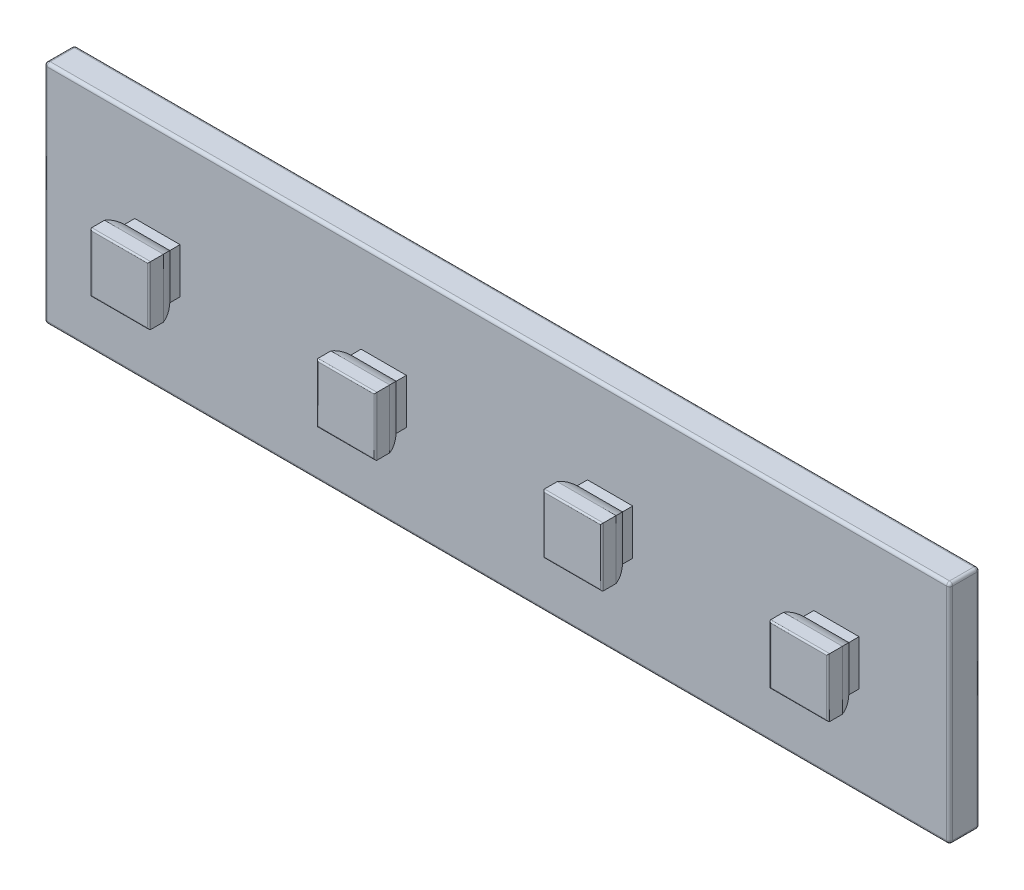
ISO-10303-21;
HEADER;
FILE_DESCRIPTION(('STEP AP214'),'2;1');
FILE_NAME('part.step','',(''),(''),'','','');
FILE_SCHEMA(('AUTOMOTIVE_DESIGN { 1 0 10303 214 1 1 1 1 }'));
ENDSEC;
DATA;
#1=APPLICATION_CONTEXT('core data for automotive mechanical design processes');
#2=APPLICATION_PROTOCOL_DEFINITION('international standard','automotive_design',2000,#1);
#3=PRODUCT_CONTEXT('',#1,'mechanical');
#4=PRODUCT('Part','Part','',(#3));
#5=PRODUCT_RELATED_PRODUCT_CATEGORY('part','',(#4));
#6=PRODUCT_DEFINITION_FORMATION('','',#4);
#7=PRODUCT_DEFINITION_CONTEXT('part definition',#1,'design');
#8=PRODUCT_DEFINITION('design','',#6,#7);
#9=PRODUCT_DEFINITION_SHAPE('','',#8);
#10=(LENGTH_UNIT() NAMED_UNIT(*) SI_UNIT(.MILLI.,.METRE.));
#11=(NAMED_UNIT(*) PLANE_ANGLE_UNIT() SI_UNIT($,.RADIAN.));
#12=(NAMED_UNIT(*) SI_UNIT($,.STERADIAN.) SOLID_ANGLE_UNIT());
#13=UNCERTAINTY_MEASURE_WITH_UNIT(LENGTH_MEASURE(1.E-05),#10,'distance_accuracy_value','');
#14=(GEOMETRIC_REPRESENTATION_CONTEXT(3) GLOBAL_UNCERTAINTY_ASSIGNED_CONTEXT((#13)) GLOBAL_UNIT_ASSIGNED_CONTEXT((#10,
#11,#12)) REPRESENTATION_CONTEXT('',''));
#15=CARTESIAN_POINT('',(0.,0.,0.));
#16=DIRECTION('',(0.,0.,1.));
#17=DIRECTION('',(1.,0.,0.));
#18=AXIS2_PLACEMENT_3D('',#15,#16,#17);
#19=CARTESIAN_POINT('',(22.5,-2.,2.));
#20=DIRECTION('',(0.,1.,0.));
#21=DIRECTION('',(0.,0.,1.));
#22=AXIS2_PLACEMENT_3D('',#19,#20,#21);
#23=CYLINDRICAL_SURFACE('',#22,2.);
#24=DIRECTION('',(0.,1.,0.));
#25=VECTOR('',#24,1.);
#26=CARTESIAN_POINT('',(21.,-2.,0.677124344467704));
#27=LINE('',#26,#25);
#28=CARTESIAN_POINT('',(21.,-1.5,0.677124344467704));
#29=VERTEX_POINT('',#28);
#30=CARTESIAN_POINT('',(21.,1.5,0.677124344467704));
#31=VERTEX_POINT('',#30);
#32=EDGE_CURVE('E379',#29,#31,#27,.T.);
#33=ORIENTED_EDGE('',*,*,#32,.F.);
#34=CARTESIAN_POINT('',(22.5,0.,2.));
#35=DIRECTION('',(-0.707106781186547,0.707106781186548,0.));
#36=DIRECTION('',(-0.707106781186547,-0.707106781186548,0.));
#37=AXIS2_PLACEMENT_3D('',#34,#35,#36);
#38=ELLIPSE('',#37,2.82842712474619,2.);
#39=CARTESIAN_POINT('',(20.55,-1.95,1.55559027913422));
#40=VERTEX_POINT('',#39);
#41=EDGE_CURVE('E373',#40,#29,#38,.F.);
#42=ORIENTED_EDGE('',*,*,#41,.F.);
#43=DIRECTION('',(0.,1.,0.));
#44=VECTOR('',#43,1.);
#45=CARTESIAN_POINT('',(20.55,-2.,1.55559027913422));
#46=LINE('',#45,#44);
#47=CARTESIAN_POINT('',(20.55,1.95,1.55559027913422));
#48=VERTEX_POINT('',#47);
#49=EDGE_CURVE('E1796',#40,#48,#46,.T.);
#50=ORIENTED_EDGE('',*,*,#49,.T.);
#51=CARTESIAN_POINT('',(22.5,0.,2.));
#52=DIRECTION('',(-0.707106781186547,-0.707106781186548,0.));
#53=DIRECTION('',(-0.707106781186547,0.707106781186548,0.));
#54=AXIS2_PLACEMENT_3D('',#51,#52,#53);
#55=ELLIPSE('',#54,2.82842712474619,2.);
#56=EDGE_CURVE('E1821',#31,#48,#55,.F.);
#57=ORIENTED_EDGE('',*,*,#56,.F.);
#58=EDGE_LOOP('',(#33,#42,#50,#57));
#59=FACE_BOUND('',#58,.T.);
#60=ADVANCED_FACE('F38',(#59),#23,.T.);
#61=CARTESIAN_POINT('',(22.5,-2.,2.));
#62=DIRECTION('',(0.,1.,0.));
#63=DIRECTION('',(0.,0.,1.));
#64=AXIS2_PLACEMENT_3D('',#61,#62,#63);
#65=CYLINDRICAL_SURFACE('',#64,2.);
#66=DIRECTION('',(0.,1.,0.));
#67=VECTOR('',#66,1.);
#68=CARTESIAN_POINT('',(24.45,-2.,1.55559027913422));
#69=LINE('',#68,#67);
#70=CARTESIAN_POINT('',(24.45,-1.95,1.55559027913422));
#71=VERTEX_POINT('',#70);
#72=CARTESIAN_POINT('',(24.45,1.95,1.55559027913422));
#73=VERTEX_POINT('',#72);
#74=EDGE_CURVE('E390',#71,#73,#69,.T.);
#75=ORIENTED_EDGE('',*,*,#74,.F.);
#76=CARTESIAN_POINT('',(22.5,0.,2.));
#77=DIRECTION('',(-0.707106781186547,-0.707106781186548,0.));
#78=DIRECTION('',(-0.707106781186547,0.707106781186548,0.));
#79=AXIS2_PLACEMENT_3D('',#76,#77,#78);
#80=ELLIPSE('',#79,2.82842712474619,2.);
#81=CARTESIAN_POINT('',(24.,-1.5,0.677124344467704));
#82=VERTEX_POINT('',#81);
#83=EDGE_CURVE('E370',#82,#71,#80,.T.);
#84=ORIENTED_EDGE('',*,*,#83,.F.);
#85=DIRECTION('',(0.,1.,0.));
#86=VECTOR('',#85,1.);
#87=CARTESIAN_POINT('',(24.,-2.,0.677124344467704));
#88=LINE('',#87,#86);
#89=CARTESIAN_POINT('',(24.,1.5,0.677124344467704));
#90=VERTEX_POINT('',#89);
#91=EDGE_CURVE('E387',#82,#90,#88,.T.);
#92=ORIENTED_EDGE('',*,*,#91,.T.);
#93=CARTESIAN_POINT('',(22.5,0.,2.));
#94=DIRECTION('',(-0.707106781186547,0.707106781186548,0.));
#95=DIRECTION('',(-0.707106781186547,-0.707106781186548,0.));
#96=AXIS2_PLACEMENT_3D('',#93,#94,#95);
#97=ELLIPSE('',#96,2.82842712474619,2.);
#98=EDGE_CURVE('E1824',#73,#90,#97,.T.);
#99=ORIENTED_EDGE('',*,*,#98,.F.);
#100=EDGE_LOOP('',(#75,#84,#92,#99));
#101=FACE_BOUND('',#100,.T.);
#102=ADVANCED_FACE('F385',(#101),#65,.T.);
#103=CARTESIAN_POINT('',(24.45,-2.,2.5));
#104=DIRECTION('',(1.,0.,0.));
#105=DIRECTION('',(0.,0.,-1.));
#106=AXIS2_PLACEMENT_3D('',#103,#104,#105);
#107=PLANE('',#106);
#108=DIRECTION('',(0.,0.,-1.));
#109=VECTOR('',#108,1.);
#110=CARTESIAN_POINT('',(24.45,1.95,1.58856217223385));
#111=LINE('',#110,#109);
#112=CARTESIAN_POINT('',(24.45,1.95,2.4));
#113=VERTEX_POINT('',#112);
#114=EDGE_CURVE('E1791',#113,#73,#111,.T.);
#115=ORIENTED_EDGE('',*,*,#114,.F.);
#116=DIRECTION('',(0.,1.,0.));
#117=VECTOR('',#116,1.);
#118=CARTESIAN_POINT('',(24.45,-2.,2.4));
#119=LINE('',#118,#117);
#120=CARTESIAN_POINT('',(24.45,-1.95,2.4));
#121=VERTEX_POINT('',#120);
#122=EDGE_CURVE('E700',#113,#121,#119,.F.);
#123=ORIENTED_EDGE('',*,*,#122,.T.);
#124=DIRECTION('',(0.,0.,-1.));
#125=VECTOR('',#124,1.);
#126=CARTESIAN_POINT('',(24.45,-1.95,1.58856217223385));
#127=LINE('',#126,#125);
#128=EDGE_CURVE('E1811',#121,#71,#127,.T.);
#129=ORIENTED_EDGE('',*,*,#128,.T.);
#130=ORIENTED_EDGE('',*,*,#74,.T.);
#131=EDGE_LOOP('',(#115,#123,#129,#130));
#132=FACE_BOUND('',#131,.T.);
#133=ADVANCED_FACE('F934',(#132),#107,.T.);
#134=CARTESIAN_POINT('',(20.55,-2.,2.5));
#135=DIRECTION('',(0.,0.,1.));
#136=DIRECTION('',(1.,0.,0.));
#137=AXIS2_PLACEMENT_3D('',#134,#135,#136);
#138=PLANE('',#137);
#139=DIRECTION('',(-1.,0.,0.));
#140=VECTOR('',#139,1.);
#141=CARTESIAN_POINT('',(20.55,1.85,2.5));
#142=LINE('',#141,#140);
#143=CARTESIAN_POINT('',(24.35,1.85,2.5));
#144=VERTEX_POINT('',#143);
#145=CARTESIAN_POINT('',(20.65,1.85,2.5));
#146=VERTEX_POINT('',#145);
#147=EDGE_CURVE('E693',#144,#146,#142,.T.);
#148=ORIENTED_EDGE('',*,*,#147,.T.);
#149=DIRECTION('',(0.,1.,0.));
#150=VECTOR('',#149,1.);
#151=CARTESIAN_POINT('',(20.65,-2.,2.5));
#152=LINE('',#151,#150);
#153=CARTESIAN_POINT('',(20.65,-1.85,2.5));
#154=VERTEX_POINT('',#153);
#155=EDGE_CURVE('E695',#146,#154,#152,.F.);
#156=ORIENTED_EDGE('',*,*,#155,.T.);
#157=DIRECTION('',(-1.,0.,0.));
#158=VECTOR('',#157,1.);
#159=CARTESIAN_POINT('',(24.45,-1.85,2.5));
#160=LINE('',#159,#158);
#161=CARTESIAN_POINT('',(24.35,-1.85,2.5));
#162=VERTEX_POINT('',#161);
#163=EDGE_CURVE('E689',#154,#162,#160,.F.);
#164=ORIENTED_EDGE('',*,*,#163,.T.);
#165=DIRECTION('',(0.,1.,0.));
#166=VECTOR('',#165,1.);
#167=CARTESIAN_POINT('',(24.35,-2.,2.5));
#168=LINE('',#167,#166);
#169=EDGE_CURVE('E691',#162,#144,#168,.T.);
#170=ORIENTED_EDGE('',*,*,#169,.T.);
#171=EDGE_LOOP('',(#148,#156,#164,#170));
#172=FACE_BOUND('',#171,.T.);
#173=ADVANCED_FACE('F1631',(#172),#138,.T.);
#174=CARTESIAN_POINT('',(20.55,-2.,2.5));
#175=DIRECTION('',(-1.,0.,0.));
#176=DIRECTION('',(0.,0.,1.));
#177=AXIS2_PLACEMENT_3D('',#174,#175,#176);
#178=PLANE('',#177);
#179=DIRECTION('',(0.,0.,-1.));
#180=VECTOR('',#179,1.);
#181=CARTESIAN_POINT('',(20.55,-1.95,1.58856217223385));
#182=LINE('',#181,#180);
#183=CARTESIAN_POINT('',(20.55,-1.95,2.4));
#184=VERTEX_POINT('',#183);
#185=EDGE_CURVE('E391',#184,#40,#182,.T.);
#186=ORIENTED_EDGE('',*,*,#185,.F.);
#187=DIRECTION('',(0.,1.,0.));
#188=VECTOR('',#187,1.);
#189=CARTESIAN_POINT('',(20.55,-2.,2.4));
#190=LINE('',#189,#188);
#191=CARTESIAN_POINT('',(20.55,1.95,2.4));
#192=VERTEX_POINT('',#191);
#193=EDGE_CURVE('E686',#184,#192,#190,.T.);
#194=ORIENTED_EDGE('',*,*,#193,.T.);
#195=DIRECTION('',(0.,0.,-1.));
#196=VECTOR('',#195,1.);
#197=CARTESIAN_POINT('',(20.55,1.95,1.58856217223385));
#198=LINE('',#197,#196);
#199=EDGE_CURVE('E1826',#192,#48,#198,.T.);
#200=ORIENTED_EDGE('',*,*,#199,.T.);
#201=ORIENTED_EDGE('',*,*,#49,.F.);
#202=EDGE_LOOP('',(#186,#194,#200,#201));
#203=FACE_BOUND('',#202,.T.);
#204=ADVANCED_FACE('F938',(#203),#178,.T.);
#205=CARTESIAN_POINT('',(-30.,7.5,0.));
#206=DIRECTION('',(0.,0.,-1.));
#207=DIRECTION('',(-1.,0.,0.));
#208=AXIS2_PLACEMENT_3D('',#205,#206,#207);
#209=PLANE('',#208);
#210=DIRECTION('',(0.,-1.,0.));
#211=VECTOR('',#210,1.);
#212=CARTESIAN_POINT('',(-29.8,-7.5,0.));
#213=LINE('',#212,#211);
#214=CARTESIAN_POINT('',(-29.8,7.3,0.));
#215=VERTEX_POINT('',#214);
#216=CARTESIAN_POINT('',(-29.8,-7.3,0.));
#217=VERTEX_POINT('',#216);
#218=EDGE_CURVE('E736',#215,#217,#213,.T.);
#219=ORIENTED_EDGE('',*,*,#218,.T.);
#220=DIRECTION('',(1.,0.,0.));
#221=VECTOR('',#220,1.);
#222=CARTESIAN_POINT('',(30.,-7.3,0.));
#223=LINE('',#222,#221);
#224=CARTESIAN_POINT('',(29.8,-7.3,0.));
#225=VERTEX_POINT('',#224);
#226=EDGE_CURVE('E738',#217,#225,#223,.T.);
#227=ORIENTED_EDGE('',*,*,#226,.T.);
#228=DIRECTION('',(0.,1.,0.));
#229=VECTOR('',#228,1.);
#230=CARTESIAN_POINT('',(29.8,7.5,0.));
#231=LINE('',#230,#229);
#232=CARTESIAN_POINT('',(29.8,7.3,0.));
#233=VERTEX_POINT('',#232);
#234=EDGE_CURVE('E734',#225,#233,#231,.T.);
#235=ORIENTED_EDGE('',*,*,#234,.T.);
#236=DIRECTION('',(-1.,0.,0.));
#237=VECTOR('',#236,1.);
#238=CARTESIAN_POINT('',(-30.,7.3,0.));
#239=LINE('',#238,#237);
#240=EDGE_CURVE('E732',#233,#215,#239,.T.);
#241=ORIENTED_EDGE('',*,*,#240,.T.);
#242=EDGE_LOOP('',(#219,#227,#235,#241));
#243=FACE_BOUND('',#242,.T.);
#244=DIRECTION('',(0.,-1.,0.));
#245=VECTOR('',#244,1.);
#246=CARTESIAN_POINT('',(-9.,-1.5,0.));
#247=LINE('',#246,#245);
#248=CARTESIAN_POINT('',(-9.,1.5,0.));
#249=VERTEX_POINT('',#248);
#250=CARTESIAN_POINT('',(-9.,-1.5,0.));
#251=VERTEX_POINT('',#250);
#252=EDGE_CURVE('E577',#249,#251,#247,.T.);
#253=ORIENTED_EDGE('',*,*,#252,.F.);
#254=DIRECTION('',(-1.,0.,0.));
#255=VECTOR('',#254,1.);
#256=CARTESIAN_POINT('',(-9.,1.5,0.));
#257=LINE('',#256,#255);
#258=CARTESIAN_POINT('',(-6.,1.5,0.));
#259=VERTEX_POINT('',#258);
#260=EDGE_CURVE('E586',#259,#249,#257,.T.);
#261=ORIENTED_EDGE('',*,*,#260,.F.);
#262=DIRECTION('',(0.,1.,0.));
#263=VECTOR('',#262,1.);
#264=CARTESIAN_POINT('',(-6.,-1.5,0.));
#265=LINE('',#264,#263);
#266=CARTESIAN_POINT('',(-6.,-1.5,0.));
#267=VERTEX_POINT('',#266);
#268=EDGE_CURVE('E583',#267,#259,#265,.T.);
#269=ORIENTED_EDGE('',*,*,#268,.F.);
#270=DIRECTION('',(1.,0.,0.));
#271=VECTOR('',#270,1.);
#272=CARTESIAN_POINT('',(-9.,-1.5,0.));
#273=LINE('',#272,#271);
#274=EDGE_CURVE('E580',#251,#267,#273,.T.);
#275=ORIENTED_EDGE('',*,*,#274,.F.);
#276=EDGE_LOOP('',(#253,#261,#269,#275));
#277=FACE_BOUND('',#276,.T.);
#278=DIRECTION('',(1.,0.,0.));
#279=VECTOR('',#278,1.);
#280=CARTESIAN_POINT('',(-21.,1.5,0.));
#281=LINE('',#280,#279);
#282=CARTESIAN_POINT('',(-24.,1.5,0.));
#283=VERTEX_POINT('',#282);
#284=CARTESIAN_POINT('',(-21.,1.5,0.));
#285=VERTEX_POINT('',#284);
#286=EDGE_CURVE('E519',#283,#285,#281,.T.);
#287=ORIENTED_EDGE('',*,*,#286,.T.);
#288=DIRECTION('',(0.,-1.,0.));
#289=VECTOR('',#288,1.);
#290=CARTESIAN_POINT('',(-21.,-1.5,0.));
#291=LINE('',#290,#289);
#292=CARTESIAN_POINT('',(-21.,-1.5,0.));
#293=VERTEX_POINT('',#292);
#294=EDGE_CURVE('E516',#285,#293,#291,.T.);
#295=ORIENTED_EDGE('',*,*,#294,.T.);
#296=DIRECTION('',(-1.,0.,0.));
#297=VECTOR('',#296,1.);
#298=CARTESIAN_POINT('',(-21.,-1.5,0.));
#299=LINE('',#298,#297);
#300=CARTESIAN_POINT('',(-24.,-1.5,0.));
#301=VERTEX_POINT('',#300);
#302=EDGE_CURVE('E525',#293,#301,#299,.T.);
#303=ORIENTED_EDGE('',*,*,#302,.T.);
#304=DIRECTION('',(0.,1.,0.));
#305=VECTOR('',#304,1.);
#306=CARTESIAN_POINT('',(-24.,-1.5,0.));
#307=LINE('',#306,#305);
#308=EDGE_CURVE('E522',#301,#283,#307,.T.);
#309=ORIENTED_EDGE('',*,*,#308,.T.);
#310=EDGE_LOOP('',(#287,#295,#303,#309));
#311=FACE_BOUND('',#310,.T.);
#312=DIRECTION('',(1.,0.,0.));
#313=VECTOR('',#312,1.);
#314=CARTESIAN_POINT('',(9.,1.5,0.));
#315=LINE('',#314,#313);
#316=CARTESIAN_POINT('',(6.,1.5,0.));
#317=VERTEX_POINT('',#316);
#318=CARTESIAN_POINT('',(9.,1.5,0.));
#319=VERTEX_POINT('',#318);
#320=EDGE_CURVE('E457',#317,#319,#315,.T.);
#321=ORIENTED_EDGE('',*,*,#320,.T.);
#322=DIRECTION('',(0.,-1.,0.));
#323=VECTOR('',#322,1.);
#324=CARTESIAN_POINT('',(9.,-1.5,0.));
#325=LINE('',#324,#323);
#326=CARTESIAN_POINT('',(9.,-1.5,0.));
#327=VERTEX_POINT('',#326);
#328=EDGE_CURVE('E454',#319,#327,#325,.T.);
#329=ORIENTED_EDGE('',*,*,#328,.T.);
#330=DIRECTION('',(-1.,0.,0.));
#331=VECTOR('',#330,1.);
#332=CARTESIAN_POINT('',(9.,-1.5,0.));
#333=LINE('',#332,#331);
#334=CARTESIAN_POINT('',(6.00000000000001,-1.5,0.));
#335=VERTEX_POINT('',#334);
#336=EDGE_CURVE('E463',#327,#335,#333,.T.);
#337=ORIENTED_EDGE('',*,*,#336,.T.);
#338=DIRECTION('',(0.,1.,0.));
#339=VECTOR('',#338,1.);
#340=CARTESIAN_POINT('',(6.,-1.5,0.));
#341=LINE('',#340,#339);
#342=EDGE_CURVE('E460',#335,#317,#341,.T.);
#343=ORIENTED_EDGE('',*,*,#342,.T.);
#344=EDGE_LOOP('',(#321,#329,#337,#343));
#345=FACE_BOUND('',#344,.T.);
#346=DIRECTION('',(0.,-1.,0.));
#347=VECTOR('',#346,1.);
#348=CARTESIAN_POINT('',(21.,-1.5,0.));
#349=LINE('',#348,#347);
#350=CARTESIAN_POINT('',(21.,1.5,0.));
#351=VERTEX_POINT('',#350);
#352=CARTESIAN_POINT('',(21.,-1.5,0.));
#353=VERTEX_POINT('',#352);
#354=EDGE_CURVE('E378',#351,#353,#349,.T.);
#355=ORIENTED_EDGE('',*,*,#354,.F.);
#356=DIRECTION('',(-1.,0.,0.));
#357=VECTOR('',#356,1.);
#358=CARTESIAN_POINT('',(21.,1.5,0.));
#359=LINE('',#358,#357);
#360=CARTESIAN_POINT('',(24.,1.5,0.));
#361=VERTEX_POINT('',#360);
#362=EDGE_CURVE('E1838',#361,#351,#359,.T.);
#363=ORIENTED_EDGE('',*,*,#362,.F.);
#364=DIRECTION('',(0.,1.,0.));
#365=VECTOR('',#364,1.);
#366=CARTESIAN_POINT('',(24.,-1.5,0.));
#367=LINE('',#366,#365);
#368=CARTESIAN_POINT('',(24.,-1.5,0.));
#369=VERTEX_POINT('',#368);
#370=EDGE_CURVE('E1836',#369,#361,#367,.T.);
#371=ORIENTED_EDGE('',*,*,#370,.F.);
#372=DIRECTION('',(1.,0.,0.));
#373=VECTOR('',#372,1.);
#374=CARTESIAN_POINT('',(21.,-1.5,0.));
#375=LINE('',#374,#373);
#376=EDGE_CURVE('E404',#353,#369,#375,.T.);
#377=ORIENTED_EDGE('',*,*,#376,.F.);
#378=EDGE_LOOP('',(#355,#363,#371,#377));
#379=FACE_BOUND('',#378,.T.);
#380=ADVANCED_FACE('F875',(#243,#277,#311,#345,#379),#209,.F.);
#381=CARTESIAN_POINT('',(9.45,-2.,2.5));
#382=DIRECTION('',(-1.,0.,0.));
#383=DIRECTION('',(0.,0.,1.));
#384=AXIS2_PLACEMENT_3D('',#381,#382,#383);
#385=PLANE('',#384);
#386=DIRECTION('',(0.,0.,-1.));
#387=VECTOR('',#386,1.);
#388=CARTESIAN_POINT('',(9.45,1.95,1.58856217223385));
#389=LINE('',#388,#387);
#390=CARTESIAN_POINT('',(9.45,1.95,2.4));
#391=VERTEX_POINT('',#390);
#392=CARTESIAN_POINT('',(9.45,1.95,1.55559027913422));
#393=VERTEX_POINT('',#392);
#394=EDGE_CURVE('E435',#391,#393,#389,.T.);
#395=ORIENTED_EDGE('',*,*,#394,.F.);
#396=DIRECTION('',(0.,1.,0.));
#397=VECTOR('',#396,1.);
#398=CARTESIAN_POINT('',(9.45,-2.,2.4));
#399=LINE('',#398,#397);
#400=CARTESIAN_POINT('',(9.45,-1.95,2.4));
#401=VERTEX_POINT('',#400);
#402=EDGE_CURVE('E672',#391,#401,#399,.F.);
#403=ORIENTED_EDGE('',*,*,#402,.T.);
#404=DIRECTION('',(0.,0.,-1.));
#405=VECTOR('',#404,1.);
#406=CARTESIAN_POINT('',(9.45,-1.95,1.58856217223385));
#407=LINE('',#406,#405);
#408=CARTESIAN_POINT('',(9.45,-1.95,1.55559027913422));
#409=VERTEX_POINT('',#408);
#410=EDGE_CURVE('E422',#401,#409,#407,.T.);
#411=ORIENTED_EDGE('',*,*,#410,.T.);
#412=DIRECTION('',(0.,1.,0.));
#413=VECTOR('',#412,1.);
#414=CARTESIAN_POINT('',(9.45,-2.,1.55559027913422));
#415=LINE('',#414,#413);
#416=EDGE_CURVE('E441',#409,#393,#415,.T.);
#417=ORIENTED_EDGE('',*,*,#416,.T.);
#418=EDGE_LOOP('',(#395,#403,#411,#417));
#419=FACE_BOUND('',#418,.T.);
#420=ADVANCED_FACE('F972',(#419),#385,.F.);
#421=CARTESIAN_POINT('',(9.45,-2.,2.5));
#422=DIRECTION('',(0.,0.,-1.));
#423=DIRECTION('',(-1.,0.,0.));
#424=AXIS2_PLACEMENT_3D('',#421,#422,#423);
#425=PLANE('',#424);
#426=DIRECTION('',(1.,0.,0.));
#427=VECTOR('',#426,1.);
#428=CARTESIAN_POINT('',(9.45,1.85,2.5));
#429=LINE('',#428,#427);
#430=CARTESIAN_POINT('',(9.35,1.85,2.5));
#431=VERTEX_POINT('',#430);
#432=CARTESIAN_POINT('',(5.65,1.85,2.5));
#433=VERTEX_POINT('',#432);
#434=EDGE_CURVE('E665',#431,#433,#429,.F.);
#435=ORIENTED_EDGE('',*,*,#434,.T.);
#436=DIRECTION('',(0.,1.,0.));
#437=VECTOR('',#436,1.);
#438=CARTESIAN_POINT('',(5.65,-2.,2.5));
#439=LINE('',#438,#437);
#440=CARTESIAN_POINT('',(5.65,-1.85,2.5));
#441=VERTEX_POINT('',#440);
#442=EDGE_CURVE('E667',#433,#441,#439,.F.);
#443=ORIENTED_EDGE('',*,*,#442,.T.);
#444=DIRECTION('',(1.,0.,0.));
#445=VECTOR('',#444,1.);
#446=CARTESIAN_POINT('',(9.45,-1.85,2.5));
#447=LINE('',#446,#445);
#448=CARTESIAN_POINT('',(9.35,-1.85,2.5));
#449=VERTEX_POINT('',#448);
#450=EDGE_CURVE('E661',#441,#449,#447,.T.);
#451=ORIENTED_EDGE('',*,*,#450,.T.);
#452=DIRECTION('',(0.,1.,0.));
#453=VECTOR('',#452,1.);
#454=CARTESIAN_POINT('',(9.35,-2.,2.5));
#455=LINE('',#454,#453);
#456=EDGE_CURVE('E663',#449,#431,#455,.T.);
#457=ORIENTED_EDGE('',*,*,#456,.T.);
#458=EDGE_LOOP('',(#435,#443,#451,#457));
#459=FACE_BOUND('',#458,.T.);
#460=ADVANCED_FACE('F975',(#459),#425,.F.);
#461=CARTESIAN_POINT('',(5.55,-2.,2.5));
#462=DIRECTION('',(1.,0.,0.));
#463=DIRECTION('',(0.,0.,-1.));
#464=AXIS2_PLACEMENT_3D('',#461,#462,#463);
#465=PLANE('',#464);
#466=DIRECTION('',(0.,0.,1.));
#467=VECTOR('',#466,1.);
#468=CARTESIAN_POINT('',(5.55,-1.95,1.58856217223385));
#469=LINE('',#468,#467);
#470=CARTESIAN_POINT('',(5.55,-1.95,1.55559027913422));
#471=VERTEX_POINT('',#470);
#472=CARTESIAN_POINT('',(5.55,-1.95,2.4));
#473=VERTEX_POINT('',#472);
#474=EDGE_CURVE('E419',#471,#473,#469,.T.);
#475=ORIENTED_EDGE('',*,*,#474,.T.);
#476=DIRECTION('',(0.,1.,0.));
#477=VECTOR('',#476,1.);
#478=CARTESIAN_POINT('',(5.55,-2.,2.4));
#479=LINE('',#478,#477);
#480=CARTESIAN_POINT('',(5.55,1.95,2.4));
#481=VERTEX_POINT('',#480);
#482=EDGE_CURVE('E658',#473,#481,#479,.T.);
#483=ORIENTED_EDGE('',*,*,#482,.T.);
#484=DIRECTION('',(0.,0.,1.));
#485=VECTOR('',#484,1.);
#486=CARTESIAN_POINT('',(5.55,1.95,1.58856217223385));
#487=LINE('',#486,#485);
#488=CARTESIAN_POINT('',(5.55,1.95,1.55559027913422));
#489=VERTEX_POINT('',#488);
#490=EDGE_CURVE('E432',#489,#481,#487,.T.);
#491=ORIENTED_EDGE('',*,*,#490,.F.);
#492=DIRECTION('',(0.,1.,0.));
#493=VECTOR('',#492,1.);
#494=CARTESIAN_POINT('',(5.55,-2.,1.55559027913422));
#495=LINE('',#494,#493);
#496=EDGE_CURVE('E445',#471,#489,#495,.T.);
#497=ORIENTED_EDGE('',*,*,#496,.F.);
#498=EDGE_LOOP('',(#475,#483,#491,#497));
#499=FACE_BOUND('',#498,.T.);
#500=ADVANCED_FACE('F979',(#499),#465,.F.);
#501=CARTESIAN_POINT('',(9.,-1.5,1.));
#502=DIRECTION('',(1.,0.,0.));
#503=DIRECTION('',(0.,0.,-1.));
#504=AXIS2_PLACEMENT_3D('',#501,#502,#503);
#505=PLANE('',#504);
#506=DIRECTION('',(0.,0.,-1.));
#507=VECTOR('',#506,1.);
#508=CARTESIAN_POINT('',(9.,1.5,1.));
#509=LINE('',#508,#507);
#510=CARTESIAN_POINT('',(9.,1.5,0.677124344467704));
#511=VERTEX_POINT('',#510);
#512=EDGE_CURVE('E472',#511,#319,#509,.T.);
#513=ORIENTED_EDGE('',*,*,#512,.F.);
#514=DIRECTION('',(0.,1.,0.));
#515=VECTOR('',#514,1.);
#516=CARTESIAN_POINT('',(9.,-2.,0.677124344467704));
#517=LINE('',#516,#515);
#518=CARTESIAN_POINT('',(9.,-1.5,0.677124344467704));
#519=VERTEX_POINT('',#518);
#520=EDGE_CURVE('E440',#519,#511,#517,.T.);
#521=ORIENTED_EDGE('',*,*,#520,.F.);
#522=DIRECTION('',(0.,0.,-1.));
#523=VECTOR('',#522,1.);
#524=CARTESIAN_POINT('',(9.,-1.5,1.));
#525=LINE('',#524,#523);
#526=EDGE_CURVE('E466',#519,#327,#525,.T.);
#527=ORIENTED_EDGE('',*,*,#526,.T.);
#528=ORIENTED_EDGE('',*,*,#328,.F.);
#529=EDGE_LOOP('',(#513,#521,#527,#528));
#530=FACE_BOUND('',#529,.T.);
#531=ADVANCED_FACE('F983',(#530),#505,.T.);
#532=CARTESIAN_POINT('',(9.,1.5,1.));
#533=DIRECTION('',(0.,1.,0.));
#534=DIRECTION('',(0.,0.,1.));
#535=AXIS2_PLACEMENT_3D('',#532,#533,#534);
#536=PLANE('',#535);
#537=DIRECTION('',(0.,0.,-1.));
#538=VECTOR('',#537,1.);
#539=CARTESIAN_POINT('',(6.,1.5,1.));
#540=LINE('',#539,#538);
#541=CARTESIAN_POINT('',(6.,1.5,0.677124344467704));
#542=VERTEX_POINT('',#541);
#543=EDGE_CURVE('E470',#542,#317,#540,.T.);
#544=ORIENTED_EDGE('',*,*,#543,.F.);
#545=DIRECTION('',(1.,0.,0.));
#546=VECTOR('',#545,1.);
#547=CARTESIAN_POINT('',(9.,1.5,0.677124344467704));
#548=LINE('',#547,#546);
#549=EDGE_CURVE('E444',#542,#511,#548,.T.);
#550=ORIENTED_EDGE('',*,*,#549,.T.);
#551=ORIENTED_EDGE('',*,*,#512,.T.);
#552=ORIENTED_EDGE('',*,*,#320,.F.);
#553=EDGE_LOOP('',(#544,#550,#551,#552));
#554=FACE_BOUND('',#553,.T.);
#555=ADVANCED_FACE('F1001',(#554),#536,.T.);
#556=CARTESIAN_POINT('',(6.,-1.5,1.));
#557=DIRECTION('',(-1.,0.,0.));
#558=DIRECTION('',(0.,0.,1.));
#559=AXIS2_PLACEMENT_3D('',#556,#557,#558);
#560=PLANE('',#559);
#561=DIRECTION('',(0.,0.,-1.));
#562=VECTOR('',#561,1.);
#563=CARTESIAN_POINT('',(6.,-1.5,1.));
#564=LINE('',#563,#562);
#565=CARTESIAN_POINT('',(6.,-1.5,0.677124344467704));
#566=VERTEX_POINT('',#565);
#567=EDGE_CURVE('E468',#566,#335,#564,.T.);
#568=ORIENTED_EDGE('',*,*,#567,.F.);
#569=DIRECTION('',(0.,1.,0.));
#570=VECTOR('',#569,1.);
#571=CARTESIAN_POINT('',(6.,-2.,0.677124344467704));
#572=LINE('',#571,#570);
#573=EDGE_CURVE('E447',#566,#542,#572,.T.);
#574=ORIENTED_EDGE('',*,*,#573,.T.);
#575=ORIENTED_EDGE('',*,*,#543,.T.);
#576=ORIENTED_EDGE('',*,*,#342,.F.);
#577=EDGE_LOOP('',(#568,#574,#575,#576));
#578=FACE_BOUND('',#577,.T.);
#579=ADVANCED_FACE('F997',(#578),#560,.T.);
#580=CARTESIAN_POINT('',(9.,-1.5,1.));
#581=DIRECTION('',(0.,-1.,0.));
#582=DIRECTION('',(0.,0.,-1.));
#583=AXIS2_PLACEMENT_3D('',#580,#581,#582);
#584=PLANE('',#583);
#585=ORIENTED_EDGE('',*,*,#526,.F.);
#586=DIRECTION('',(-1.,0.,0.));
#587=VECTOR('',#586,1.);
#588=CARTESIAN_POINT('',(9.,-1.5,0.677124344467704));
#589=LINE('',#588,#587);
#590=EDGE_CURVE('E647',#519,#566,#589,.T.);
#591=ORIENTED_EDGE('',*,*,#590,.T.);
#592=ORIENTED_EDGE('',*,*,#567,.T.);
#593=ORIENTED_EDGE('',*,*,#336,.F.);
#594=EDGE_LOOP('',(#585,#591,#592,#593));
#595=FACE_BOUND('',#594,.T.);
#596=ADVANCED_FACE('F993',(#595),#584,.T.);
#597=CARTESIAN_POINT('',(-20.55,-2.,2.5));
#598=DIRECTION('',(-1.,0.,0.));
#599=DIRECTION('',(0.,0.,1.));
#600=AXIS2_PLACEMENT_3D('',#597,#598,#599);
#601=PLANE('',#600);
#602=DIRECTION('',(0.,0.,-1.));
#603=VECTOR('',#602,1.);
#604=CARTESIAN_POINT('',(-20.55,1.95,1.58856217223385));
#605=LINE('',#604,#603);
#606=CARTESIAN_POINT('',(-20.55,1.95,2.4));
#607=VERTEX_POINT('',#606);
#608=CARTESIAN_POINT('',(-20.55,1.95,1.55559027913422));
#609=VERTEX_POINT('',#608);
#610=EDGE_CURVE('E497',#607,#609,#605,.T.);
#611=ORIENTED_EDGE('',*,*,#610,.F.);
#612=DIRECTION('',(0.,1.,0.));
#613=VECTOR('',#612,1.);
#614=CARTESIAN_POINT('',(-20.55,-2.,2.4));
#615=LINE('',#614,#613);
#616=CARTESIAN_POINT('',(-20.55,-1.95,2.4));
#617=VERTEX_POINT('',#616);
#618=EDGE_CURVE('E643',#607,#617,#615,.F.);
#619=ORIENTED_EDGE('',*,*,#618,.T.);
#620=DIRECTION('',(0.,0.,-1.));
#621=VECTOR('',#620,1.);
#622=CARTESIAN_POINT('',(-20.55,-1.95,1.58856217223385));
#623=LINE('',#622,#621);
#624=CARTESIAN_POINT('',(-20.55,-1.95,1.55559027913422));
#625=VERTEX_POINT('',#624);
#626=EDGE_CURVE('E484',#617,#625,#623,.T.);
#627=ORIENTED_EDGE('',*,*,#626,.T.);
#628=DIRECTION('',(0.,1.,0.));
#629=VECTOR('',#628,1.);
#630=CARTESIAN_POINT('',(-20.55,-2.,1.55559027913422));
#631=LINE('',#630,#629);
#632=EDGE_CURVE('E503',#625,#609,#631,.T.);
#633=ORIENTED_EDGE('',*,*,#632,.T.);
#634=EDGE_LOOP('',(#611,#619,#627,#633));
#635=FACE_BOUND('',#634,.T.);
#636=ADVANCED_FACE('F996',(#635),#601,.F.);
#637=CARTESIAN_POINT('',(-20.55,-2.,2.5));
#638=DIRECTION('',(0.,0.,-1.));
#639=DIRECTION('',(-1.,0.,0.));
#640=AXIS2_PLACEMENT_3D('',#637,#638,#639);
#641=PLANE('',#640);
#642=DIRECTION('',(1.,0.,0.));
#643=VECTOR('',#642,1.);
#644=CARTESIAN_POINT('',(-20.55,1.85,2.5));
#645=LINE('',#644,#643);
#646=CARTESIAN_POINT('',(-20.65,1.85,2.5));
#647=VERTEX_POINT('',#646);
#648=CARTESIAN_POINT('',(-24.35,1.85,2.5));
#649=VERTEX_POINT('',#648);
#650=EDGE_CURVE('E636',#647,#649,#645,.F.);
#651=ORIENTED_EDGE('',*,*,#650,.T.);
#652=DIRECTION('',(0.,1.,0.));
#653=VECTOR('',#652,1.);
#654=CARTESIAN_POINT('',(-24.35,-2.,2.5));
#655=LINE('',#654,#653);
#656=CARTESIAN_POINT('',(-24.35,-1.85,2.5));
#657=VERTEX_POINT('',#656);
#658=EDGE_CURVE('E638',#649,#657,#655,.F.);
#659=ORIENTED_EDGE('',*,*,#658,.T.);
#660=DIRECTION('',(1.,0.,0.));
#661=VECTOR('',#660,1.);
#662=CARTESIAN_POINT('',(-20.55,-1.85,2.5));
#663=LINE('',#662,#661);
#664=CARTESIAN_POINT('',(-20.65,-1.85,2.5));
#665=VERTEX_POINT('',#664);
#666=EDGE_CURVE('E632',#657,#665,#663,.T.);
#667=ORIENTED_EDGE('',*,*,#666,.T.);
#668=DIRECTION('',(0.,1.,0.));
#669=VECTOR('',#668,1.);
#670=CARTESIAN_POINT('',(-20.65,-2.,2.5));
#671=LINE('',#670,#669);
#672=EDGE_CURVE('E634',#665,#647,#671,.T.);
#673=ORIENTED_EDGE('',*,*,#672,.T.);
#674=EDGE_LOOP('',(#651,#659,#667,#673));
#675=FACE_BOUND('',#674,.T.);
#676=ADVANCED_FACE('F1029',(#675),#641,.F.);
#677=CARTESIAN_POINT('',(-24.45,-2.,2.5));
#678=DIRECTION('',(1.,0.,0.));
#679=DIRECTION('',(0.,0.,-1.));
#680=AXIS2_PLACEMENT_3D('',#677,#678,#679);
#681=PLANE('',#680);
#682=DIRECTION('',(0.,0.,1.));
#683=VECTOR('',#682,1.);
#684=CARTESIAN_POINT('',(-24.45,-1.95,1.58856217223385));
#685=LINE('',#684,#683);
#686=CARTESIAN_POINT('',(-24.45,-1.95,1.55559027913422));
#687=VERTEX_POINT('',#686);
#688=CARTESIAN_POINT('',(-24.45,-1.95,2.4));
#689=VERTEX_POINT('',#688);
#690=EDGE_CURVE('E481',#687,#689,#685,.T.);
#691=ORIENTED_EDGE('',*,*,#690,.T.);
#692=DIRECTION('',(0.,1.,0.));
#693=VECTOR('',#692,1.);
#694=CARTESIAN_POINT('',(-24.45,-2.,2.4));
#695=LINE('',#694,#693);
#696=CARTESIAN_POINT('',(-24.45,1.95,2.4));
#697=VERTEX_POINT('',#696);
#698=EDGE_CURVE('E629',#689,#697,#695,.T.);
#699=ORIENTED_EDGE('',*,*,#698,.T.);
#700=DIRECTION('',(0.,0.,1.));
#701=VECTOR('',#700,1.);
#702=CARTESIAN_POINT('',(-24.45,1.95,1.58856217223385));
#703=LINE('',#702,#701);
#704=CARTESIAN_POINT('',(-24.45,1.95,1.55559027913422));
#705=VERTEX_POINT('',#704);
#706=EDGE_CURVE('E494',#705,#697,#703,.T.);
#707=ORIENTED_EDGE('',*,*,#706,.F.);
#708=DIRECTION('',(0.,1.,0.));
#709=VECTOR('',#708,1.);
#710=CARTESIAN_POINT('',(-24.45,-2.,1.55559027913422));
#711=LINE('',#710,#709);
#712=EDGE_CURVE('E507',#687,#705,#711,.T.);
#713=ORIENTED_EDGE('',*,*,#712,.F.);
#714=EDGE_LOOP('',(#691,#699,#707,#713));
#715=FACE_BOUND('',#714,.T.);
#716=ADVANCED_FACE('F1033',(#715),#681,.F.);
#717=CARTESIAN_POINT('',(-21.,-1.5,1.));
#718=DIRECTION('',(1.,0.,0.));
#719=DIRECTION('',(0.,0.,-1.));
#720=AXIS2_PLACEMENT_3D('',#717,#718,#719);
#721=PLANE('',#720);
#722=DIRECTION('',(0.,0.,-1.));
#723=VECTOR('',#722,1.);
#724=CARTESIAN_POINT('',(-21.,1.5,1.));
#725=LINE('',#724,#723);
#726=CARTESIAN_POINT('',(-21.,1.5,0.677124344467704));
#727=VERTEX_POINT('',#726);
#728=EDGE_CURVE('E534',#727,#285,#725,.T.);
#729=ORIENTED_EDGE('',*,*,#728,.F.);
#730=DIRECTION('',(0.,1.,0.));
#731=VECTOR('',#730,1.);
#732=CARTESIAN_POINT('',(-21.,-2.,0.677124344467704));
#733=LINE('',#732,#731);
#734=CARTESIAN_POINT('',(-21.,-1.5,0.677124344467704));
#735=VERTEX_POINT('',#734);
#736=EDGE_CURVE('E502',#735,#727,#733,.T.);
#737=ORIENTED_EDGE('',*,*,#736,.F.);
#738=DIRECTION('',(0.,0.,-1.));
#739=VECTOR('',#738,1.);
#740=CARTESIAN_POINT('',(-21.,-1.5,1.));
#741=LINE('',#740,#739);
#742=EDGE_CURVE('E528',#735,#293,#741,.T.);
#743=ORIENTED_EDGE('',*,*,#742,.T.);
#744=ORIENTED_EDGE('',*,*,#294,.F.);
#745=EDGE_LOOP('',(#729,#737,#743,#744));
#746=FACE_BOUND('',#745,.T.);
#747=ADVANCED_FACE('F1037',(#746),#721,.T.);
#748=CARTESIAN_POINT('',(-21.,1.5,1.));
#749=DIRECTION('',(0.,1.,0.));
#750=DIRECTION('',(0.,0.,1.));
#751=AXIS2_PLACEMENT_3D('',#748,#749,#750);
#752=PLANE('',#751);
#753=DIRECTION('',(0.,0.,-1.));
#754=VECTOR('',#753,1.);
#755=CARTESIAN_POINT('',(-24.,1.5,1.));
#756=LINE('',#755,#754);
#757=CARTESIAN_POINT('',(-24.,1.5,0.677124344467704));
#758=VERTEX_POINT('',#757);
#759=EDGE_CURVE('E532',#758,#283,#756,.T.);
#760=ORIENTED_EDGE('',*,*,#759,.F.);
#761=DIRECTION('',(1.,0.,0.));
#762=VECTOR('',#761,1.);
#763=CARTESIAN_POINT('',(-21.,1.5,0.677124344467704));
#764=LINE('',#763,#762);
#765=EDGE_CURVE('E506',#758,#727,#764,.T.);
#766=ORIENTED_EDGE('',*,*,#765,.T.);
#767=ORIENTED_EDGE('',*,*,#728,.T.);
#768=ORIENTED_EDGE('',*,*,#286,.F.);
#769=EDGE_LOOP('',(#760,#766,#767,#768));
#770=FACE_BOUND('',#769,.T.);
#771=ADVANCED_FACE('F1055',(#770),#752,.T.);
#772=CARTESIAN_POINT('',(-24.,-1.5,1.));
#773=DIRECTION('',(-1.,0.,0.));
#774=DIRECTION('',(0.,0.,1.));
#775=AXIS2_PLACEMENT_3D('',#772,#773,#774);
#776=PLANE('',#775);
#777=DIRECTION('',(0.,0.,-1.));
#778=VECTOR('',#777,1.);
#779=CARTESIAN_POINT('',(-24.,-1.5,1.));
#780=LINE('',#779,#778);
#781=CARTESIAN_POINT('',(-24.,-1.5,0.677124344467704));
#782=VERTEX_POINT('',#781);
#783=EDGE_CURVE('E530',#782,#301,#780,.T.);
#784=ORIENTED_EDGE('',*,*,#783,.F.);
#785=DIRECTION('',(0.,1.,0.));
#786=VECTOR('',#785,1.);
#787=CARTESIAN_POINT('',(-24.,-2.,0.677124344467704));
#788=LINE('',#787,#786);
#789=EDGE_CURVE('E509',#782,#758,#788,.T.);
#790=ORIENTED_EDGE('',*,*,#789,.T.);
#791=ORIENTED_EDGE('',*,*,#759,.T.);
#792=ORIENTED_EDGE('',*,*,#308,.F.);
#793=EDGE_LOOP('',(#784,#790,#791,#792));
#794=FACE_BOUND('',#793,.T.);
#795=ADVANCED_FACE('F1051',(#794),#776,.T.);
#796=CARTESIAN_POINT('',(-21.,-1.5,1.));
#797=DIRECTION('',(0.,-1.,0.));
#798=DIRECTION('',(0.,0.,-1.));
#799=AXIS2_PLACEMENT_3D('',#796,#797,#798);
#800=PLANE('',#799);
#801=ORIENTED_EDGE('',*,*,#742,.F.);
#802=DIRECTION('',(-1.,0.,0.));
#803=VECTOR('',#802,1.);
#804=CARTESIAN_POINT('',(-21.,-1.5,0.677124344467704));
#805=LINE('',#804,#803);
#806=EDGE_CURVE('E618',#735,#782,#805,.T.);
#807=ORIENTED_EDGE('',*,*,#806,.T.);
#808=ORIENTED_EDGE('',*,*,#783,.T.);
#809=ORIENTED_EDGE('',*,*,#302,.F.);
#810=EDGE_LOOP('',(#801,#807,#808,#809));
#811=FACE_BOUND('',#810,.T.);
#812=ADVANCED_FACE('F1047',(#811),#800,.T.);
#813=CARTESIAN_POINT('',(-7.5,-2.,2.));
#814=DIRECTION('',(0.,1.,0.));
#815=DIRECTION('',(0.,0.,1.));
#816=AXIS2_PLACEMENT_3D('',#813,#814,#815);
#817=CYLINDRICAL_SURFACE('',#816,2.);
#818=DIRECTION('',(0.,1.,0.));
#819=VECTOR('',#818,1.);
#820=CARTESIAN_POINT('',(-9.,-2.,0.677124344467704));
#821=LINE('',#820,#819);
#822=CARTESIAN_POINT('',(-9.,-1.5,0.677124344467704));
#823=VERTEX_POINT('',#822);
#824=CARTESIAN_POINT('',(-9.,1.5,0.677124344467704));
#825=VERTEX_POINT('',#824);
#826=EDGE_CURVE('E563',#823,#825,#821,.T.);
#827=ORIENTED_EDGE('',*,*,#826,.F.);
#828=CARTESIAN_POINT('',(-7.5,0.,2.));
#829=DIRECTION('',(-0.707106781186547,0.707106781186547,0.));
#830=DIRECTION('',(-0.707106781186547,-0.707106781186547,0.));
#831=AXIS2_PLACEMENT_3D('',#828,#829,#830);
#832=ELLIPSE('',#831,2.82842712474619,2.);
#833=CARTESIAN_POINT('',(-9.45,-1.95,1.55559027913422));
#834=VERTEX_POINT('',#833);
#835=EDGE_CURVE('E537',#834,#823,#832,.F.);
#836=ORIENTED_EDGE('',*,*,#835,.F.);
#837=DIRECTION('',(0.,1.,0.));
#838=VECTOR('',#837,1.);
#839=CARTESIAN_POINT('',(-9.45,-2.,1.55559027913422));
#840=LINE('',#839,#838);
#841=CARTESIAN_POINT('',(-9.45,1.95,1.55559027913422));
#842=VERTEX_POINT('',#841);
#843=EDGE_CURVE('E562',#834,#842,#840,.T.);
#844=ORIENTED_EDGE('',*,*,#843,.T.);
#845=CARTESIAN_POINT('',(-7.5,0.,2.));
#846=DIRECTION('',(-0.707106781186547,-0.707106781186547,0.));
#847=DIRECTION('',(-0.707106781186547,0.707106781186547,0.));
#848=AXIS2_PLACEMENT_3D('',#845,#846,#847);
#849=ELLIPSE('',#848,2.82842712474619,2.);
#850=EDGE_CURVE('E550',#825,#842,#849,.F.);
#851=ORIENTED_EDGE('',*,*,#850,.F.);
#852=EDGE_LOOP('',(#827,#836,#844,#851));
#853=FACE_BOUND('',#852,.T.);
#854=ADVANCED_FACE('F1050',(#853),#817,.T.);
#855=CARTESIAN_POINT('',(-7.5,-2.,2.));
#856=DIRECTION('',(0.,1.,0.));
#857=DIRECTION('',(0.,0.,1.));
#858=AXIS2_PLACEMENT_3D('',#855,#856,#857);
#859=CYLINDRICAL_SURFACE('',#858,2.);
#860=DIRECTION('',(0.,1.,0.));
#861=VECTOR('',#860,1.);
#862=CARTESIAN_POINT('',(-5.55,-2.,1.55559027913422));
#863=LINE('',#862,#861);
#864=CARTESIAN_POINT('',(-5.55,-1.95,1.55559027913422));
#865=VERTEX_POINT('',#864);
#866=CARTESIAN_POINT('',(-5.55,1.95,1.55559027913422));
#867=VERTEX_POINT('',#866);
#868=EDGE_CURVE('E570',#865,#867,#863,.T.);
#869=ORIENTED_EDGE('',*,*,#868,.F.);
#870=CARTESIAN_POINT('',(-7.5,0.,2.));
#871=DIRECTION('',(-0.707106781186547,-0.707106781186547,0.));
#872=DIRECTION('',(-0.707106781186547,0.707106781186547,0.));
#873=AXIS2_PLACEMENT_3D('',#870,#871,#872);
#874=ELLIPSE('',#873,2.82842712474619,2.);
#875=CARTESIAN_POINT('',(-6.,-1.5,0.677124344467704));
#876=VERTEX_POINT('',#875);
#877=EDGE_CURVE('E539',#876,#865,#874,.T.);
#878=ORIENTED_EDGE('',*,*,#877,.F.);
#879=DIRECTION('',(0.,1.,0.));
#880=VECTOR('',#879,1.);
#881=CARTESIAN_POINT('',(-6.,-2.,0.677124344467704));
#882=LINE('',#881,#880);
#883=CARTESIAN_POINT('',(-6.,1.5,0.677124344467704));
#884=VERTEX_POINT('',#883);
#885=EDGE_CURVE('E567',#876,#884,#882,.T.);
#886=ORIENTED_EDGE('',*,*,#885,.T.);
#887=CARTESIAN_POINT('',(-7.5,0.,2.));
#888=DIRECTION('',(-0.707106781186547,0.707106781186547,0.));
#889=DIRECTION('',(-0.707106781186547,-0.707106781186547,0.));
#890=AXIS2_PLACEMENT_3D('',#887,#888,#889);
#891=ELLIPSE('',#890,2.82842712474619,2.);
#892=EDGE_CURVE('E553',#867,#884,#891,.T.);
#893=ORIENTED_EDGE('',*,*,#892,.F.);
#894=EDGE_LOOP('',(#869,#878,#886,#893));
#895=FACE_BOUND('',#894,.T.);
#896=ADVANCED_FACE('F1081',(#895),#859,.T.);
#897=CARTESIAN_POINT('',(-5.55,-2.,2.5));
#898=DIRECTION('',(1.,0.,0.));
#899=DIRECTION('',(0.,0.,-1.));
#900=AXIS2_PLACEMENT_3D('',#897,#898,#899);
#901=PLANE('',#900);
#902=DIRECTION('',(0.,0.,-1.));
#903=VECTOR('',#902,1.);
#904=CARTESIAN_POINT('',(-5.55,1.95,1.58856217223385));
#905=LINE('',#904,#903);
#906=CARTESIAN_POINT('',(-5.55,1.95,2.4));
#907=VERTEX_POINT('',#906);
#908=EDGE_CURVE('E560',#907,#867,#905,.T.);
#909=ORIENTED_EDGE('',*,*,#908,.F.);
#910=DIRECTION('',(0.,1.,0.));
#911=VECTOR('',#910,1.);
#912=CARTESIAN_POINT('',(-5.55,-2.,2.4));
#913=LINE('',#912,#911);
#914=CARTESIAN_POINT('',(-5.55,-1.95,2.4));
#915=VERTEX_POINT('',#914);
#916=EDGE_CURVE('E614',#907,#915,#913,.F.);
#917=ORIENTED_EDGE('',*,*,#916,.T.);
#918=DIRECTION('',(0.,0.,-1.));
#919=VECTOR('',#918,1.);
#920=CARTESIAN_POINT('',(-5.55,-1.95,1.58856217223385));
#921=LINE('',#920,#919);
#922=EDGE_CURVE('E548',#915,#865,#921,.T.);
#923=ORIENTED_EDGE('',*,*,#922,.T.);
#924=ORIENTED_EDGE('',*,*,#868,.T.);
#925=EDGE_LOOP('',(#909,#917,#923,#924));
#926=FACE_BOUND('',#925,.T.);
#927=ADVANCED_FACE('F1084',(#926),#901,.T.);
#928=CARTESIAN_POINT('',(-9.45,-2.,2.5));
#929=DIRECTION('',(0.,0.,1.));
#930=DIRECTION('',(1.,0.,0.));
#931=AXIS2_PLACEMENT_3D('',#928,#929,#930);
#932=PLANE('',#931);
#933=DIRECTION('',(-1.,0.,0.));
#934=VECTOR('',#933,1.);
#935=CARTESIAN_POINT('',(-9.45,1.85,2.5));
#936=LINE('',#935,#934);
#937=CARTESIAN_POINT('',(-5.65,1.85,2.5));
#938=VERTEX_POINT('',#937);
#939=CARTESIAN_POINT('',(-9.35,1.85,2.5));
#940=VERTEX_POINT('',#939);
#941=EDGE_CURVE('E607',#938,#940,#936,.T.);
#942=ORIENTED_EDGE('',*,*,#941,.T.);
#943=DIRECTION('',(0.,1.,0.));
#944=VECTOR('',#943,1.);
#945=CARTESIAN_POINT('',(-9.35,-2.,2.5));
#946=LINE('',#945,#944);
#947=CARTESIAN_POINT('',(-9.35,-1.85,2.5));
#948=VERTEX_POINT('',#947);
#949=EDGE_CURVE('E609',#940,#948,#946,.F.);
#950=ORIENTED_EDGE('',*,*,#949,.T.);
#951=DIRECTION('',(-1.,0.,0.));
#952=VECTOR('',#951,1.);
#953=CARTESIAN_POINT('',(-5.55,-1.85,2.5));
#954=LINE('',#953,#952);
#955=CARTESIAN_POINT('',(-5.65,-1.85,2.5));
#956=VERTEX_POINT('',#955);
#957=EDGE_CURVE('E603',#948,#956,#954,.F.);
#958=ORIENTED_EDGE('',*,*,#957,.T.);
#959=DIRECTION('',(0.,1.,0.));
#960=VECTOR('',#959,1.);
#961=CARTESIAN_POINT('',(-5.65,-2.,2.5));
#962=LINE('',#961,#960);
#963=EDGE_CURVE('E605',#956,#938,#962,.T.);
#964=ORIENTED_EDGE('',*,*,#963,.T.);
#965=EDGE_LOOP('',(#942,#950,#958,#964));
#966=FACE_BOUND('',#965,.T.);
#967=ADVANCED_FACE('F1088',(#966),#932,.T.);
#968=CARTESIAN_POINT('',(-9.45,-2.,2.5));
#969=DIRECTION('',(-1.,0.,0.));
#970=DIRECTION('',(0.,0.,1.));
#971=AXIS2_PLACEMENT_3D('',#968,#969,#970);
#972=PLANE('',#971);
#973=DIRECTION('',(0.,0.,-1.));
#974=VECTOR('',#973,1.);
#975=CARTESIAN_POINT('',(-9.45,-1.95,1.58856217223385));
#976=LINE('',#975,#974);
#977=CARTESIAN_POINT('',(-9.45,-1.95,2.4));
#978=VERTEX_POINT('',#977);
#979=EDGE_CURVE('E543',#978,#834,#976,.T.);
#980=ORIENTED_EDGE('',*,*,#979,.F.);
#981=DIRECTION('',(0.,1.,0.));
#982=VECTOR('',#981,1.);
#983=CARTESIAN_POINT('',(-9.45,-2.,2.4));
#984=LINE('',#983,#982);
#985=CARTESIAN_POINT('',(-9.45,1.95,2.4));
#986=VERTEX_POINT('',#985);
#987=EDGE_CURVE('E600',#978,#986,#984,.T.);
#988=ORIENTED_EDGE('',*,*,#987,.T.);
#989=DIRECTION('',(0.,0.,-1.));
#990=VECTOR('',#989,1.);
#991=CARTESIAN_POINT('',(-9.45,1.95,1.58856217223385));
#992=LINE('',#991,#990);
#993=EDGE_CURVE('E555',#986,#842,#992,.T.);
#994=ORIENTED_EDGE('',*,*,#993,.T.);
#995=ORIENTED_EDGE('',*,*,#843,.F.);
#996=EDGE_LOOP('',(#980,#988,#994,#995));
#997=FACE_BOUND('',#996,.T.);
#998=ADVANCED_FACE('F1092',(#997),#972,.T.);
#999=CARTESIAN_POINT('',(-30.,-7.5,-2.));
#1000=DIRECTION('',(-1.,0.,0.));
#1001=DIRECTION('',(0.,0.,1.));
#1002=AXIS2_PLACEMENT_3D('',#999,#1000,#1001);
#1003=PLANE('',#1002);
#1004=DIRECTION('',(0.,-1.,0.));
#1005=VECTOR('',#1004,1.);
#1006=CARTESIAN_POINT('',(-30.,-7.5,-1.8));
#1007=LINE('',#1006,#1005);
#1008=CARTESIAN_POINT('',(-30.,7.3,-1.8));
#1009=VERTEX_POINT('',#1008);
#1010=CARTESIAN_POINT('',(-30.,-7.3,-1.8));
#1011=VERTEX_POINT('',#1010);
#1012=EDGE_CURVE('E745',#1009,#1011,#1007,.T.);
#1013=ORIENTED_EDGE('',*,*,#1012,.T.);
#1014=DIRECTION('',(0.,0.,1.));
#1015=VECTOR('',#1014,1.);
#1016=CARTESIAN_POINT('',(-30.,-7.3,-2.));
#1017=LINE('',#1016,#1015);
#1018=CARTESIAN_POINT('',(-30.,-7.3,-0.2));
#1019=VERTEX_POINT('',#1018);
#1020=EDGE_CURVE('E747',#1011,#1019,#1017,.T.);
#1021=ORIENTED_EDGE('',*,*,#1020,.T.);
#1022=DIRECTION('',(0.,-1.,0.));
#1023=VECTOR('',#1022,1.);
#1024=CARTESIAN_POINT('',(-30.,7.5,-0.2));
#1025=LINE('',#1024,#1023);
#1026=CARTESIAN_POINT('',(-30.,7.3,-0.2));
#1027=VERTEX_POINT('',#1026);
#1028=EDGE_CURVE('E743',#1019,#1027,#1025,.F.);
#1029=ORIENTED_EDGE('',*,*,#1028,.T.);
#1030=DIRECTION('',(0.,0.,1.));
#1031=VECTOR('',#1030,1.);
#1032=CARTESIAN_POINT('',(-30.,7.3,-2.));
#1033=LINE('',#1032,#1031);
#1034=EDGE_CURVE('E741',#1027,#1009,#1033,.F.);
#1035=ORIENTED_EDGE('',*,*,#1034,.T.);
#1036=EDGE_LOOP('',(#1013,#1021,#1029,#1035));
#1037=FACE_BOUND('',#1036,.T.);
#1038=ADVANCED_FACE('F859',(#1037),#1003,.T.);
#1039=CARTESIAN_POINT('',(-30.,7.5,-2.));
#1040=DIRECTION('',(0.,1.,0.));
#1041=DIRECTION('',(0.,0.,1.));
#1042=AXIS2_PLACEMENT_3D('',#1039,#1040,#1041);
#1043=PLANE('',#1042);
#1044=DIRECTION('',(-1.,0.,0.));
#1045=VECTOR('',#1044,1.);
#1046=CARTESIAN_POINT('',(-30.,7.5,-1.8));
#1047=LINE('',#1046,#1045);
#1048=CARTESIAN_POINT('',(29.8,7.5,-1.8));
#1049=VERTEX_POINT('',#1048);
#1050=CARTESIAN_POINT('',(-29.8,7.5,-1.8));
#1051=VERTEX_POINT('',#1050);
#1052=EDGE_CURVE('E47',#1049,#1051,#1047,.T.);
#1053=ORIENTED_EDGE('',*,*,#1052,.T.);
#1054=DIRECTION('',(0.,0.,1.));
#1055=VECTOR('',#1054,1.);
#1056=CARTESIAN_POINT('',(-29.8,7.5,-2.));
#1057=LINE('',#1056,#1055);
#1058=CARTESIAN_POINT('',(-29.8,7.5,-0.2));
#1059=VERTEX_POINT('',#1058);
#1060=EDGE_CURVE('E12',#1051,#1059,#1057,.T.);
#1061=ORIENTED_EDGE('',*,*,#1060,.T.);
#1062=DIRECTION('',(-1.,0.,0.));
#1063=VECTOR('',#1062,1.);
#1064=CARTESIAN_POINT('',(30.,7.5,-0.2));
#1065=LINE('',#1064,#1063);
#1066=CARTESIAN_POINT('',(29.8,7.5,-0.2));
#1067=VERTEX_POINT('',#1066);
#1068=EDGE_CURVE('E759',#1059,#1067,#1065,.F.);
#1069=ORIENTED_EDGE('',*,*,#1068,.T.);
#1070=DIRECTION('',(0.,0.,1.));
#1071=VECTOR('',#1070,1.);
#1072=CARTESIAN_POINT('',(29.8,7.5,-2.));
#1073=LINE('',#1072,#1071);
#1074=EDGE_CURVE('E58',#1067,#1049,#1073,.F.);
#1075=ORIENTED_EDGE('',*,*,#1074,.T.);
#1076=EDGE_LOOP('',(#1053,#1061,#1069,#1075));
#1077=FACE_BOUND('',#1076,.T.);
#1078=ADVANCED_FACE('F839',(#1077),#1043,.T.);
#1079=CARTESIAN_POINT('',(30.,-7.5,-2.));
#1080=DIRECTION('',(1.,0.,0.));
#1081=DIRECTION('',(0.,0.,-1.));
#1082=AXIS2_PLACEMENT_3D('',#1079,#1080,#1081);
#1083=PLANE('',#1082);
#1084=DIRECTION('',(0.,0.,1.));
#1085=VECTOR('',#1084,1.);
#1086=CARTESIAN_POINT('',(30.,-7.3,-2.));
#1087=LINE('',#1086,#1085);
#1088=CARTESIAN_POINT('',(30.,-7.3,-0.2));
#1089=VERTEX_POINT('',#1088);
#1090=CARTESIAN_POINT('',(30.,-7.3,-1.8));
#1091=VERTEX_POINT('',#1090);
#1092=EDGE_CURVE('E754',#1089,#1091,#1087,.F.);
#1093=ORIENTED_EDGE('',*,*,#1092,.T.);
#1094=DIRECTION('',(0.,1.,0.));
#1095=VECTOR('',#1094,1.);
#1096=CARTESIAN_POINT('',(30.,-7.5,-1.8));
#1097=LINE('',#1096,#1095);
#1098=CARTESIAN_POINT('',(30.,7.3,-1.8));
#1099=VERTEX_POINT('',#1098);
#1100=EDGE_CURVE('E756',#1091,#1099,#1097,.T.);
#1101=ORIENTED_EDGE('',*,*,#1100,.T.);
#1102=DIRECTION('',(0.,0.,1.));
#1103=VECTOR('',#1102,1.);
#1104=CARTESIAN_POINT('',(30.,7.3,-2.));
#1105=LINE('',#1104,#1103);
#1106=CARTESIAN_POINT('',(30.,7.3,-0.2));
#1107=VERTEX_POINT('',#1106);
#1108=EDGE_CURVE('E750',#1099,#1107,#1105,.T.);
#1109=ORIENTED_EDGE('',*,*,#1108,.T.);
#1110=DIRECTION('',(0.,1.,0.));
#1111=VECTOR('',#1110,1.);
#1112=CARTESIAN_POINT('',(30.,-7.5,-0.2));
#1113=LINE('',#1112,#1111);
#1114=EDGE_CURVE('E752',#1107,#1089,#1113,.F.);
#1115=ORIENTED_EDGE('',*,*,#1114,.T.);
#1116=EDGE_LOOP('',(#1093,#1101,#1109,#1115));
#1117=FACE_BOUND('',#1116,.T.);
#1118=ADVANCED_FACE('F917',(#1117),#1083,.T.);
#1119=CARTESIAN_POINT('',(-30.,-7.5,-2.));
#1120=DIRECTION('',(0.,-1.,0.));
#1121=DIRECTION('',(0.,0.,-1.));
#1122=AXIS2_PLACEMENT_3D('',#1119,#1120,#1121);
#1123=PLANE('',#1122);
#1124=DIRECTION('',(1.,0.,0.));
#1125=VECTOR('',#1124,1.);
#1126=CARTESIAN_POINT('',(-30.,-7.5,-0.2));
#1127=LINE('',#1126,#1125);
#1128=CARTESIAN_POINT('',(29.8,-7.5,-0.2));
#1129=VERTEX_POINT('',#1128);
#1130=CARTESIAN_POINT('',(-29.8,-7.5,-0.2));
#1131=VERTEX_POINT('',#1130);
#1132=EDGE_CURVE('E716',#1129,#1131,#1127,.F.);
#1133=ORIENTED_EDGE('',*,*,#1132,.T.);
#1134=DIRECTION('',(0.,0.,1.));
#1135=VECTOR('',#1134,1.);
#1136=CARTESIAN_POINT('',(-29.8,-7.5,-2.));
#1137=LINE('',#1136,#1135);
#1138=CARTESIAN_POINT('',(-29.8,-7.5,-1.8));
#1139=VERTEX_POINT('',#1138);
#1140=EDGE_CURVE('E721',#1131,#1139,#1137,.F.);
#1141=ORIENTED_EDGE('',*,*,#1140,.T.);
#1142=DIRECTION('',(1.,0.,0.));
#1143=VECTOR('',#1142,1.);
#1144=CARTESIAN_POINT('',(-30.,-7.5,-1.8));
#1145=LINE('',#1144,#1143);
#1146=CARTESIAN_POINT('',(29.8,-7.5,-1.8));
#1147=VERTEX_POINT('',#1146);
#1148=EDGE_CURVE('E718',#1139,#1147,#1145,.T.);
#1149=ORIENTED_EDGE('',*,*,#1148,.T.);
#1150=DIRECTION('',(0.,0.,1.));
#1151=VECTOR('',#1150,1.);
#1152=CARTESIAN_POINT('',(29.8,-7.5,-2.));
#1153=LINE('',#1152,#1151);
#1154=EDGE_CURVE('E704',#1147,#1129,#1153,.T.);
#1155=ORIENTED_EDGE('',*,*,#1154,.T.);
#1156=EDGE_LOOP('',(#1133,#1141,#1149,#1155));
#1157=FACE_BOUND('',#1156,.T.);
#1158=ADVANCED_FACE('F915',(#1157),#1123,.T.);
#1159=CARTESIAN_POINT('',(-30.,7.5,-2.));
#1160=DIRECTION('',(0.,0.,-1.));
#1161=DIRECTION('',(-1.,0.,0.));
#1162=AXIS2_PLACEMENT_3D('',#1159,#1160,#1161);
#1163=PLANE('',#1162);
#1164=DIRECTION('',(0.,1.,0.));
#1165=VECTOR('',#1164,1.);
#1166=CARTESIAN_POINT('',(29.8,7.5,-2.));
#1167=LINE('',#1166,#1165);
#1168=CARTESIAN_POINT('',(29.8,7.3,-2.));
#1169=VERTEX_POINT('',#1168);
#1170=CARTESIAN_POINT('',(29.8,-7.3,-2.));
#1171=VERTEX_POINT('',#1170);
#1172=EDGE_CURVE('E725',#1169,#1171,#1167,.F.);
#1173=ORIENTED_EDGE('',*,*,#1172,.T.);
#1174=DIRECTION('',(1.,0.,0.));
#1175=VECTOR('',#1174,1.);
#1176=CARTESIAN_POINT('',(-30.,-7.3,-2.));
#1177=LINE('',#1176,#1175);
#1178=CARTESIAN_POINT('',(-29.8,-7.3,-2.));
#1179=VERTEX_POINT('',#1178);
#1180=EDGE_CURVE('E729',#1171,#1179,#1177,.F.);
#1181=ORIENTED_EDGE('',*,*,#1180,.T.);
#1182=DIRECTION('',(0.,-1.,0.));
#1183=VECTOR('',#1182,1.);
#1184=CARTESIAN_POINT('',(-29.8,7.5,-2.));
#1185=LINE('',#1184,#1183);
#1186=CARTESIAN_POINT('',(-29.8,7.3,-2.));
#1187=VERTEX_POINT('',#1186);
#1188=EDGE_CURVE('E727',#1179,#1187,#1185,.F.);
#1189=ORIENTED_EDGE('',*,*,#1188,.T.);
#1190=DIRECTION('',(-1.,0.,0.));
#1191=VECTOR('',#1190,1.);
#1192=CARTESIAN_POINT('',(-30.,7.3,-2.));
#1193=LINE('',#1192,#1191);
#1194=EDGE_CURVE('E723',#1187,#1169,#1193,.F.);
#1195=ORIENTED_EDGE('',*,*,#1194,.T.);
#1196=EDGE_LOOP('',(#1173,#1181,#1189,#1195));
#1197=FACE_BOUND('',#1196,.T.);
#1198=ADVANCED_FACE('F902',(#1197),#1163,.T.);
#1199=CARTESIAN_POINT('',(-9.,-1.5,1.));
#1200=DIRECTION('',(1.,0.,0.));
#1201=DIRECTION('',(0.,0.,-1.));
#1202=AXIS2_PLACEMENT_3D('',#1199,#1200,#1201);
#1203=PLANE('',#1202);
#1204=DIRECTION('',(0.,0.,-1.));
#1205=VECTOR('',#1204,1.);
#1206=CARTESIAN_POINT('',(-9.,-1.5,1.));
#1207=LINE('',#1206,#1205);
#1208=EDGE_CURVE('E595',#823,#251,#1207,.T.);
#1209=ORIENTED_EDGE('',*,*,#1208,.F.);
#1210=ORIENTED_EDGE('',*,*,#826,.T.);
#1211=DIRECTION('',(0.,0.,-1.));
#1212=VECTOR('',#1211,1.);
#1213=CARTESIAN_POINT('',(-9.,1.5,1.));
#1214=LINE('',#1213,#1212);
#1215=EDGE_CURVE('E589',#825,#249,#1214,.T.);
#1216=ORIENTED_EDGE('',*,*,#1215,.T.);
#1217=ORIENTED_EDGE('',*,*,#252,.T.);
#1218=EDGE_LOOP('',(#1209,#1210,#1216,#1217));
#1219=FACE_BOUND('',#1218,.T.);
#1220=ADVANCED_FACE('F923',(#1219),#1203,.F.);
#1221=CARTESIAN_POINT('',(-9.,-1.5,1.));
#1222=DIRECTION('',(0.,1.,0.));
#1223=DIRECTION('',(0.,0.,1.));
#1224=AXIS2_PLACEMENT_3D('',#1221,#1222,#1223);
#1225=PLANE('',#1224);
#1226=DIRECTION('',(0.,0.,-1.));
#1227=VECTOR('',#1226,1.);
#1228=CARTESIAN_POINT('',(-6.,-1.5,1.));
#1229=LINE('',#1228,#1227);
#1230=EDGE_CURVE('E593',#876,#267,#1229,.T.);
#1231=ORIENTED_EDGE('',*,*,#1230,.F.);
#1232=DIRECTION('',(-1.,0.,0.));
#1233=VECTOR('',#1232,1.);
#1234=CARTESIAN_POINT('',(-9.,-1.5,0.677124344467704));
#1235=LINE('',#1234,#1233);
#1236=EDGE_CURVE('E566',#876,#823,#1235,.T.);
#1237=ORIENTED_EDGE('',*,*,#1236,.T.);
#1238=ORIENTED_EDGE('',*,*,#1208,.T.);
#1239=ORIENTED_EDGE('',*,*,#274,.T.);
#1240=EDGE_LOOP('',(#1231,#1237,#1238,#1239));
#1241=FACE_BOUND('',#1240,.T.);
#1242=ADVANCED_FACE('F1106',(#1241),#1225,.F.);
#1243=CARTESIAN_POINT('',(-6.,-1.5,1.));
#1244=DIRECTION('',(-1.,0.,0.));
#1245=DIRECTION('',(0.,0.,1.));
#1246=AXIS2_PLACEMENT_3D('',#1243,#1244,#1245);
#1247=PLANE('',#1246);
#1248=DIRECTION('',(0.,0.,-1.));
#1249=VECTOR('',#1248,1.);
#1250=CARTESIAN_POINT('',(-6.,1.5,1.));
#1251=LINE('',#1250,#1249);
#1252=EDGE_CURVE('E591',#884,#259,#1251,.T.);
#1253=ORIENTED_EDGE('',*,*,#1252,.F.);
#1254=ORIENTED_EDGE('',*,*,#885,.F.);
#1255=ORIENTED_EDGE('',*,*,#1230,.T.);
#1256=ORIENTED_EDGE('',*,*,#268,.T.);
#1257=EDGE_LOOP('',(#1253,#1254,#1255,#1256));
#1258=FACE_BOUND('',#1257,.T.);
#1259=ADVANCED_FACE('F1102',(#1258),#1247,.F.);
#1260=CARTESIAN_POINT('',(-9.,1.5,1.));
#1261=DIRECTION('',(0.,-1.,0.));
#1262=DIRECTION('',(0.,0.,-1.));
#1263=AXIS2_PLACEMENT_3D('',#1260,#1261,#1262);
#1264=PLANE('',#1263);
#1265=ORIENTED_EDGE('',*,*,#1215,.F.);
#1266=DIRECTION('',(1.,0.,0.));
#1267=VECTOR('',#1266,1.);
#1268=CARTESIAN_POINT('',(-9.,1.5,0.677124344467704));
#1269=LINE('',#1268,#1267);
#1270=EDGE_CURVE('E597',#825,#884,#1269,.T.);
#1271=ORIENTED_EDGE('',*,*,#1270,.T.);
#1272=ORIENTED_EDGE('',*,*,#1252,.T.);
#1273=ORIENTED_EDGE('',*,*,#260,.T.);
#1274=EDGE_LOOP('',(#1265,#1271,#1272,#1273));
#1275=FACE_BOUND('',#1274,.T.);
#1276=ADVANCED_FACE('F1079',(#1275),#1264,.F.);
#1277=CARTESIAN_POINT('',(30.001,0.,2.));
#1278=DIRECTION('',(-1.,0.,0.));
#1279=DIRECTION('',(0.,0.,1.));
#1280=AXIS2_PLACEMENT_3D('',#1277,#1278,#1279);
#1281=CYLINDRICAL_SURFACE('',#1280,2.);
#1282=ORIENTED_EDGE('',*,*,#850,.T.);
#1283=DIRECTION('',(-1.,0.,0.));
#1284=VECTOR('',#1283,1.);
#1285=CARTESIAN_POINT('',(30.001,1.95,1.55559027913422));
#1286=LINE('',#1285,#1284);
#1287=EDGE_CURVE('E557',#867,#842,#1286,.T.);
#1288=ORIENTED_EDGE('',*,*,#1287,.F.);
#1289=ORIENTED_EDGE('',*,*,#892,.T.);
#1290=ORIENTED_EDGE('',*,*,#1270,.F.);
#1291=EDGE_LOOP('',(#1282,#1288,#1289,#1290));
#1292=FACE_BOUND('',#1291,.T.);
#1293=ADVANCED_FACE('F1075',(#1292),#1281,.T.);
#1294=CARTESIAN_POINT('',(30.001,1.95,1.58856217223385));
#1295=DIRECTION('',(0.,1.,0.));
#1296=DIRECTION('',(0.,0.,1.));
#1297=AXIS2_PLACEMENT_3D('',#1294,#1295,#1296);
#1298=PLANE('',#1297);
#1299=ORIENTED_EDGE('',*,*,#993,.F.);
#1300=DIRECTION('',(-1.,0.,0.));
#1301=VECTOR('',#1300,1.);
#1302=CARTESIAN_POINT('',(30.001,1.95,2.4));
#1303=LINE('',#1302,#1301);
#1304=EDGE_CURVE('E612',#986,#907,#1303,.F.);
#1305=ORIENTED_EDGE('',*,*,#1304,.T.);
#1306=ORIENTED_EDGE('',*,*,#908,.T.);
#1307=ORIENTED_EDGE('',*,*,#1287,.T.);
#1308=EDGE_LOOP('',(#1299,#1305,#1306,#1307));
#1309=FACE_BOUND('',#1308,.T.);
#1310=ADVANCED_FACE('F1067',(#1309),#1298,.T.);
#1311=CARTESIAN_POINT('',(30.001,0.,2.));
#1312=DIRECTION('',(-1.,0.,0.));
#1313=DIRECTION('',(0.,0.,1.));
#1314=AXIS2_PLACEMENT_3D('',#1311,#1312,#1313);
#1315=CYLINDRICAL_SURFACE('',#1314,2.);
#1316=ORIENTED_EDGE('',*,*,#835,.T.);
#1317=ORIENTED_EDGE('',*,*,#1236,.F.);
#1318=ORIENTED_EDGE('',*,*,#877,.T.);
#1319=DIRECTION('',(-1.,0.,0.));
#1320=VECTOR('',#1319,1.);
#1321=CARTESIAN_POINT('',(30.001,-1.95,1.55559027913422));
#1322=LINE('',#1321,#1320);
#1323=EDGE_CURVE('E545',#865,#834,#1322,.T.);
#1324=ORIENTED_EDGE('',*,*,#1323,.T.);
#1325=EDGE_LOOP('',(#1316,#1317,#1318,#1324));
#1326=FACE_BOUND('',#1325,.T.);
#1327=ADVANCED_FACE('F1063',(#1326),#1315,.T.);
#1328=CARTESIAN_POINT('',(30.001,-1.95,1.58856217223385));
#1329=DIRECTION('',(0.,1.,0.));
#1330=DIRECTION('',(0.,0.,1.));
#1331=AXIS2_PLACEMENT_3D('',#1328,#1329,#1330);
#1332=PLANE('',#1331);
#1333=ORIENTED_EDGE('',*,*,#922,.F.);
#1334=DIRECTION('',(-1.,0.,0.));
#1335=VECTOR('',#1334,1.);
#1336=CARTESIAN_POINT('',(-9.45,-1.95,2.4));
#1337=LINE('',#1336,#1335);
#1338=EDGE_CURVE('E616',#915,#978,#1337,.T.);
#1339=ORIENTED_EDGE('',*,*,#1338,.T.);
#1340=ORIENTED_EDGE('',*,*,#979,.T.);
#1341=ORIENTED_EDGE('',*,*,#1323,.F.);
#1342=EDGE_LOOP('',(#1333,#1339,#1340,#1341));
#1343=FACE_BOUND('',#1342,.T.);
#1344=ADVANCED_FACE('F1066',(#1343),#1332,.F.);
#1345=CARTESIAN_POINT('',(-5.65,-2.,2.4));
#1346=DIRECTION('',(0.,1.,0.));
#1347=DIRECTION('',(0.,0.,1.));
#1348=AXIS2_PLACEMENT_3D('',#1345,#1346,#1347);
#1349=CYLINDRICAL_SURFACE('',#1348,0.1);
#1350=CARTESIAN_POINT('',(-5.65,1.85,2.4));
#1351=DIRECTION('',(-0.707106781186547,0.707106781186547,0.));
#1352=DIRECTION('',(0.707106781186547,0.707106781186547,0.));
#1353=AXIS2_PLACEMENT_3D('',#1350,#1351,#1352);
#1354=ELLIPSE('',#1353,0.14142135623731,0.1);
#1355=EDGE_CURVE('E622',#938,#907,#1354,.T.);
#1356=ORIENTED_EDGE('',*,*,#1355,.F.);
#1357=ORIENTED_EDGE('',*,*,#963,.F.);
#1358=CARTESIAN_POINT('',(-5.65,-1.85,2.4));
#1359=DIRECTION('',(0.707106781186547,0.707106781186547,0.));
#1360=DIRECTION('',(0.707106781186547,-0.707106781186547,0.));
#1361=AXIS2_PLACEMENT_3D('',#1358,#1359,#1360);
#1362=ELLIPSE('',#1361,0.14142135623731,0.1);
#1363=EDGE_CURVE('E540',#915,#956,#1362,.F.);
#1364=ORIENTED_EDGE('',*,*,#1363,.F.);
#1365=ORIENTED_EDGE('',*,*,#916,.F.);
#1366=EDGE_LOOP('',(#1356,#1357,#1364,#1365));
#1367=FACE_BOUND('',#1366,.T.);
#1368=ADVANCED_FACE('F1071',(#1367),#1349,.T.);
#1369=CARTESIAN_POINT('',(30.001,-1.85,2.4));
#1370=DIRECTION('',(1.,0.,0.));
#1371=DIRECTION('',(0.,0.,-1.));
#1372=AXIS2_PLACEMENT_3D('',#1369,#1370,#1371);
#1373=CYLINDRICAL_SURFACE('',#1372,0.1);
#1374=ORIENTED_EDGE('',*,*,#1363,.T.);
#1375=ORIENTED_EDGE('',*,*,#957,.F.);
#1376=CARTESIAN_POINT('',(-9.35,-1.85,2.4));
#1377=DIRECTION('',(0.707106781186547,-0.707106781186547,0.));
#1378=DIRECTION('',(0.707106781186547,0.707106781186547,0.));
#1379=AXIS2_PLACEMENT_3D('',#1376,#1377,#1378);
#1380=ELLIPSE('',#1379,0.14142135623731,0.1);
#1381=EDGE_CURVE('E620',#978,#948,#1380,.F.);
#1382=ORIENTED_EDGE('',*,*,#1381,.F.);
#1383=ORIENTED_EDGE('',*,*,#1338,.F.);
#1384=EDGE_LOOP('',(#1374,#1375,#1382,#1383));
#1385=FACE_BOUND('',#1384,.T.);
#1386=ADVANCED_FACE('F1129',(#1385),#1373,.T.);
#1387=CARTESIAN_POINT('',(-9.45,1.85,2.4));
#1388=DIRECTION('',(-1.,0.,0.));
#1389=DIRECTION('',(0.,0.,1.));
#1390=AXIS2_PLACEMENT_3D('',#1387,#1388,#1389);
#1391=CYLINDRICAL_SURFACE('',#1390,0.1);
#1392=ORIENTED_EDGE('',*,*,#1355,.T.);
#1393=ORIENTED_EDGE('',*,*,#1304,.F.);
#1394=CARTESIAN_POINT('',(-9.35,1.85,2.4));
#1395=DIRECTION('',(-0.707106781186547,-0.707106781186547,0.));
#1396=DIRECTION('',(-0.707106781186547,0.707106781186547,0.));
#1397=AXIS2_PLACEMENT_3D('',#1394,#1395,#1396);
#1398=ELLIPSE('',#1397,0.14142135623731,0.1);
#1399=EDGE_CURVE('E536',#940,#986,#1398,.T.);
#1400=ORIENTED_EDGE('',*,*,#1399,.F.);
#1401=ORIENTED_EDGE('',*,*,#941,.F.);
#1402=EDGE_LOOP('',(#1392,#1393,#1400,#1401));
#1403=FACE_BOUND('',#1402,.T.);
#1404=ADVANCED_FACE('F1125',(#1403),#1391,.T.);
#1405=CARTESIAN_POINT('',(-9.35,-2.,2.4));
#1406=DIRECTION('',(0.,1.,0.));
#1407=DIRECTION('',(0.,0.,1.));
#1408=AXIS2_PLACEMENT_3D('',#1405,#1406,#1407);
#1409=CYLINDRICAL_SURFACE('',#1408,0.1);
#1410=ORIENTED_EDGE('',*,*,#1381,.T.);
#1411=ORIENTED_EDGE('',*,*,#949,.F.);
#1412=ORIENTED_EDGE('',*,*,#1399,.T.);
#1413=ORIENTED_EDGE('',*,*,#987,.F.);
#1414=EDGE_LOOP('',(#1410,#1411,#1412,#1413));
#1415=FACE_BOUND('',#1414,.T.);
#1416=ADVANCED_FACE('F1045',(#1415),#1409,.T.);
#1417=CARTESIAN_POINT('',(-22.5,-2.,2.));
#1418=DIRECTION('',(0.,1.,0.));
#1419=DIRECTION('',(0.,0.,1.));
#1420=AXIS2_PLACEMENT_3D('',#1417,#1418,#1419);
#1421=CYLINDRICAL_SURFACE('',#1420,2.);
#1422=ORIENTED_EDGE('',*,*,#632,.F.);
#1423=CARTESIAN_POINT('',(-22.5,0.,2.));
#1424=DIRECTION('',(0.707106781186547,0.707106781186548,0.));
#1425=DIRECTION('',(0.707106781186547,-0.707106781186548,0.));
#1426=AXIS2_PLACEMENT_3D('',#1423,#1424,#1425);
#1427=ELLIPSE('',#1426,2.82842712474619,2.);
#1428=EDGE_CURVE('E475',#735,#625,#1427,.F.);
#1429=ORIENTED_EDGE('',*,*,#1428,.F.);
#1430=ORIENTED_EDGE('',*,*,#736,.T.);
#1431=CARTESIAN_POINT('',(-22.5,0.,2.));
#1432=DIRECTION('',(0.707106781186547,-0.707106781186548,0.));
#1433=DIRECTION('',(0.707106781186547,0.707106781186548,0.));
#1434=AXIS2_PLACEMENT_3D('',#1431,#1432,#1433);
#1435=ELLIPSE('',#1434,2.82842712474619,2.);
#1436=EDGE_CURVE('E489',#609,#727,#1435,.F.);
#1437=ORIENTED_EDGE('',*,*,#1436,.F.);
#1438=EDGE_LOOP('',(#1422,#1429,#1430,#1437));
#1439=FACE_BOUND('',#1438,.T.);
#1440=ADVANCED_FACE('F1041',(#1439),#1421,.T.);
#1441=CARTESIAN_POINT('',(-22.5,-2.,2.));
#1442=DIRECTION('',(0.,1.,0.));
#1443=DIRECTION('',(0.,0.,1.));
#1444=AXIS2_PLACEMENT_3D('',#1441,#1442,#1443);
#1445=CYLINDRICAL_SURFACE('',#1444,2.);
#1446=ORIENTED_EDGE('',*,*,#789,.F.);
#1447=CARTESIAN_POINT('',(-22.5,0.,2.));
#1448=DIRECTION('',(0.707106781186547,-0.707106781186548,0.));
#1449=DIRECTION('',(0.707106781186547,0.707106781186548,0.));
#1450=AXIS2_PLACEMENT_3D('',#1447,#1448,#1449);
#1451=ELLIPSE('',#1450,2.82842712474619,2.);
#1452=EDGE_CURVE('E478',#687,#782,#1451,.T.);
#1453=ORIENTED_EDGE('',*,*,#1452,.F.);
#1454=ORIENTED_EDGE('',*,*,#712,.T.);
#1455=CARTESIAN_POINT('',(-22.5,0.,2.));
#1456=DIRECTION('',(0.707106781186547,0.707106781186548,0.));
#1457=DIRECTION('',(0.707106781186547,-0.707106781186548,0.));
#1458=AXIS2_PLACEMENT_3D('',#1455,#1456,#1457);
#1459=ELLIPSE('',#1458,2.82842712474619,2.);
#1460=EDGE_CURVE('E491',#758,#705,#1459,.T.);
#1461=ORIENTED_EDGE('',*,*,#1460,.F.);
#1462=EDGE_LOOP('',(#1446,#1453,#1454,#1461));
#1463=FACE_BOUND('',#1462,.T.);
#1464=ADVANCED_FACE('F1025',(#1463),#1445,.T.);
#1465=CARTESIAN_POINT('',(-30.001,0.,2.));
#1466=DIRECTION('',(1.,0.,0.));
#1467=DIRECTION('',(0.,0.,-1.));
#1468=AXIS2_PLACEMENT_3D('',#1465,#1466,#1467);
#1469=CYLINDRICAL_SURFACE('',#1468,2.);
#1470=ORIENTED_EDGE('',*,*,#1436,.T.);
#1471=ORIENTED_EDGE('',*,*,#765,.F.);
#1472=ORIENTED_EDGE('',*,*,#1460,.T.);
#1473=DIRECTION('',(1.,0.,0.));
#1474=VECTOR('',#1473,1.);
#1475=CARTESIAN_POINT('',(-30.001,1.95,1.55559027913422));
#1476=LINE('',#1475,#1474);
#1477=EDGE_CURVE('E499',#705,#609,#1476,.T.);
#1478=ORIENTED_EDGE('',*,*,#1477,.T.);
#1479=EDGE_LOOP('',(#1470,#1471,#1472,#1478));
#1480=FACE_BOUND('',#1479,.T.);
#1481=ADVANCED_FACE('F1021',(#1480),#1469,.T.);
#1482=CARTESIAN_POINT('',(-30.001,1.95,1.58856217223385));
#1483=DIRECTION('',(0.,-1.,0.));
#1484=DIRECTION('',(0.,0.,-1.));
#1485=AXIS2_PLACEMENT_3D('',#1482,#1483,#1484);
#1486=PLANE('',#1485);
#1487=ORIENTED_EDGE('',*,*,#706,.T.);
#1488=DIRECTION('',(1.,0.,0.));
#1489=VECTOR('',#1488,1.);
#1490=CARTESIAN_POINT('',(-30.001,1.95,2.4));
#1491=LINE('',#1490,#1489);
#1492=EDGE_CURVE('E641',#697,#607,#1491,.T.);
#1493=ORIENTED_EDGE('',*,*,#1492,.T.);
#1494=ORIENTED_EDGE('',*,*,#610,.T.);
#1495=ORIENTED_EDGE('',*,*,#1477,.F.);
#1496=EDGE_LOOP('',(#1487,#1493,#1494,#1495));
#1497=FACE_BOUND('',#1496,.T.);
#1498=ADVANCED_FACE('F1013',(#1497),#1486,.F.);
#1499=CARTESIAN_POINT('',(-30.001,-1.95,1.58856217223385));
#1500=DIRECTION('',(0.,-1.,0.));
#1501=DIRECTION('',(0.,0.,-1.));
#1502=AXIS2_PLACEMENT_3D('',#1499,#1500,#1501);
#1503=PLANE('',#1502);
#1504=ORIENTED_EDGE('',*,*,#626,.F.);
#1505=DIRECTION('',(1.,0.,0.));
#1506=VECTOR('',#1505,1.);
#1507=CARTESIAN_POINT('',(-24.45,-1.95,2.4));
#1508=LINE('',#1507,#1506);
#1509=EDGE_CURVE('E645',#617,#689,#1508,.F.);
#1510=ORIENTED_EDGE('',*,*,#1509,.T.);
#1511=ORIENTED_EDGE('',*,*,#690,.F.);
#1512=DIRECTION('',(1.,0.,0.));
#1513=VECTOR('',#1512,1.);
#1514=CARTESIAN_POINT('',(-30.001,-1.95,1.55559027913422));
#1515=LINE('',#1514,#1513);
#1516=EDGE_CURVE('E486',#687,#625,#1515,.T.);
#1517=ORIENTED_EDGE('',*,*,#1516,.T.);
#1518=EDGE_LOOP('',(#1504,#1510,#1511,#1517));
#1519=FACE_BOUND('',#1518,.T.);
#1520=ADVANCED_FACE('F1009',(#1519),#1503,.T.);
#1521=CARTESIAN_POINT('',(-30.001,0.,2.));
#1522=DIRECTION('',(1.,0.,0.));
#1523=DIRECTION('',(0.,0.,-1.));
#1524=AXIS2_PLACEMENT_3D('',#1521,#1522,#1523);
#1525=CYLINDRICAL_SURFACE('',#1524,2.);
#1526=ORIENTED_EDGE('',*,*,#1428,.T.);
#1527=ORIENTED_EDGE('',*,*,#1516,.F.);
#1528=ORIENTED_EDGE('',*,*,#1452,.T.);
#1529=ORIENTED_EDGE('',*,*,#806,.F.);
#1530=EDGE_LOOP('',(#1526,#1527,#1528,#1529));
#1531=FACE_BOUND('',#1530,.T.);
#1532=ADVANCED_FACE('F1012',(#1531),#1525,.T.);
#1533=CARTESIAN_POINT('',(-20.65,-2.,2.4));
#1534=DIRECTION('',(0.,1.,0.));
#1535=DIRECTION('',(0.,0.,1.));
#1536=AXIS2_PLACEMENT_3D('',#1533,#1534,#1535);
#1537=CYLINDRICAL_SURFACE('',#1536,0.1);
#1538=CARTESIAN_POINT('',(-20.65,1.85,2.4));
#1539=DIRECTION('',(-0.707106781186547,0.707106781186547,0.));
#1540=DIRECTION('',(0.707106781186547,0.707106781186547,0.));
#1541=AXIS2_PLACEMENT_3D('',#1538,#1539,#1540);
#1542=ELLIPSE('',#1541,0.14142135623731,0.1);
#1543=EDGE_CURVE('E651',#647,#607,#1542,.T.);
#1544=ORIENTED_EDGE('',*,*,#1543,.F.);
#1545=ORIENTED_EDGE('',*,*,#672,.F.);
#1546=CARTESIAN_POINT('',(-20.65,-1.85,2.4));
#1547=DIRECTION('',(-0.707106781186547,-0.707106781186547,0.));
#1548=DIRECTION('',(-0.707106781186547,0.707106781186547,0.));
#1549=AXIS2_PLACEMENT_3D('',#1546,#1547,#1548);
#1550=ELLIPSE('',#1549,0.14142135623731,0.1);
#1551=EDGE_CURVE('E479',#617,#665,#1550,.T.);
#1552=ORIENTED_EDGE('',*,*,#1551,.F.);
#1553=ORIENTED_EDGE('',*,*,#618,.F.);
#1554=EDGE_LOOP('',(#1544,#1545,#1552,#1553));
#1555=FACE_BOUND('',#1554,.T.);
#1556=ADVANCED_FACE('F1017',(#1555),#1537,.T.);
#1557=CARTESIAN_POINT('',(-20.55,-1.85,2.4));
#1558=DIRECTION('',(-1.,0.,0.));
#1559=DIRECTION('',(0.,0.,1.));
#1560=AXIS2_PLACEMENT_3D('',#1557,#1558,#1559);
#1561=CYLINDRICAL_SURFACE('',#1560,0.1);
#1562=ORIENTED_EDGE('',*,*,#1551,.T.);
#1563=ORIENTED_EDGE('',*,*,#666,.F.);
#1564=CARTESIAN_POINT('',(-24.35,-1.85,2.4));
#1565=DIRECTION('',(-0.707106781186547,0.707106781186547,0.));
#1566=DIRECTION('',(-0.707106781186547,-0.707106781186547,0.));
#1567=AXIS2_PLACEMENT_3D('',#1564,#1565,#1566);
#1568=ELLIPSE('',#1567,0.14142135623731,0.1);
#1569=EDGE_CURVE('E649',#689,#657,#1568,.T.);
#1570=ORIENTED_EDGE('',*,*,#1569,.F.);
#1571=ORIENTED_EDGE('',*,*,#1509,.F.);
#1572=EDGE_LOOP('',(#1562,#1563,#1570,#1571));
#1573=FACE_BOUND('',#1572,.T.);
#1574=ADVANCED_FACE('F1143',(#1573),#1561,.T.);
#1575=CARTESIAN_POINT('',(-30.001,1.85,2.4));
#1576=DIRECTION('',(1.,0.,0.));
#1577=DIRECTION('',(0.,0.,-1.));
#1578=AXIS2_PLACEMENT_3D('',#1575,#1576,#1577);
#1579=CYLINDRICAL_SURFACE('',#1578,0.1);
#1580=ORIENTED_EDGE('',*,*,#1543,.T.);
#1581=ORIENTED_EDGE('',*,*,#1492,.F.);
#1582=CARTESIAN_POINT('',(-24.35,1.85,2.4));
#1583=DIRECTION('',(0.707106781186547,0.707106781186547,0.));
#1584=DIRECTION('',(0.707106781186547,-0.707106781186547,0.));
#1585=AXIS2_PLACEMENT_3D('',#1582,#1583,#1584);
#1586=ELLIPSE('',#1585,0.14142135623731,0.1);
#1587=EDGE_CURVE('E474',#649,#697,#1586,.F.);
#1588=ORIENTED_EDGE('',*,*,#1587,.F.);
#1589=ORIENTED_EDGE('',*,*,#650,.F.);
#1590=EDGE_LOOP('',(#1580,#1581,#1588,#1589));
#1591=FACE_BOUND('',#1590,.T.);
#1592=ADVANCED_FACE('F1139',(#1591),#1579,.T.);
#1593=CARTESIAN_POINT('',(-24.35,-2.,2.4));
#1594=DIRECTION('',(0.,1.,0.));
#1595=DIRECTION('',(0.,0.,1.));
#1596=AXIS2_PLACEMENT_3D('',#1593,#1594,#1595);
#1597=CYLINDRICAL_SURFACE('',#1596,0.1);
#1598=ORIENTED_EDGE('',*,*,#1569,.T.);
#1599=ORIENTED_EDGE('',*,*,#658,.F.);
#1600=ORIENTED_EDGE('',*,*,#1587,.T.);
#1601=ORIENTED_EDGE('',*,*,#698,.F.);
#1602=EDGE_LOOP('',(#1598,#1599,#1600,#1601));
#1603=FACE_BOUND('',#1602,.T.);
#1604=ADVANCED_FACE('F991',(#1603),#1597,.T.);
#1605=CARTESIAN_POINT('',(7.5,-2.,2.));
#1606=DIRECTION('',(0.,1.,0.));
#1607=DIRECTION('',(0.,0.,1.));
#1608=AXIS2_PLACEMENT_3D('',#1605,#1606,#1607);
#1609=CYLINDRICAL_SURFACE('',#1608,2.);
#1610=ORIENTED_EDGE('',*,*,#416,.F.);
#1611=CARTESIAN_POINT('',(7.5,0.,2.));
#1612=DIRECTION('',(0.707106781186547,0.707106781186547,0.));
#1613=DIRECTION('',(0.707106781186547,-0.707106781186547,0.));
#1614=AXIS2_PLACEMENT_3D('',#1611,#1612,#1613);
#1615=ELLIPSE('',#1614,2.82842712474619,2.);
#1616=EDGE_CURVE('E413',#519,#409,#1615,.F.);
#1617=ORIENTED_EDGE('',*,*,#1616,.F.);
#1618=ORIENTED_EDGE('',*,*,#520,.T.);
#1619=CARTESIAN_POINT('',(7.5,0.,2.));
#1620=DIRECTION('',(0.707106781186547,-0.707106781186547,0.));
#1621=DIRECTION('',(0.707106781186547,0.707106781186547,0.));
#1622=AXIS2_PLACEMENT_3D('',#1619,#1620,#1621);
#1623=ELLIPSE('',#1622,2.82842712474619,2.);
#1624=EDGE_CURVE('E427',#393,#511,#1623,.F.);
#1625=ORIENTED_EDGE('',*,*,#1624,.F.);
#1626=EDGE_LOOP('',(#1610,#1617,#1618,#1625));
#1627=FACE_BOUND('',#1626,.T.);
#1628=ADVANCED_FACE('F987',(#1627),#1609,.T.);
#1629=CARTESIAN_POINT('',(7.5,-2.,2.));
#1630=DIRECTION('',(0.,1.,0.));
#1631=DIRECTION('',(0.,0.,1.));
#1632=AXIS2_PLACEMENT_3D('',#1629,#1630,#1631);
#1633=CYLINDRICAL_SURFACE('',#1632,2.);
#1634=ORIENTED_EDGE('',*,*,#573,.F.);
#1635=CARTESIAN_POINT('',(7.5,0.,2.));
#1636=DIRECTION('',(0.707106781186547,-0.707106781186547,0.));
#1637=DIRECTION('',(0.707106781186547,0.707106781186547,0.));
#1638=AXIS2_PLACEMENT_3D('',#1635,#1636,#1637);
#1639=ELLIPSE('',#1638,2.82842712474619,2.);
#1640=EDGE_CURVE('E416',#471,#566,#1639,.T.);
#1641=ORIENTED_EDGE('',*,*,#1640,.F.);
#1642=ORIENTED_EDGE('',*,*,#496,.T.);
#1643=CARTESIAN_POINT('',(7.5,0.,2.));
#1644=DIRECTION('',(0.707106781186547,0.707106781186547,0.));
#1645=DIRECTION('',(0.707106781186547,-0.707106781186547,0.));
#1646=AXIS2_PLACEMENT_3D('',#1643,#1644,#1645);
#1647=ELLIPSE('',#1646,2.82842712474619,2.);
#1648=EDGE_CURVE('E429',#542,#489,#1647,.T.);
#1649=ORIENTED_EDGE('',*,*,#1648,.F.);
#1650=EDGE_LOOP('',(#1634,#1641,#1642,#1649));
#1651=FACE_BOUND('',#1650,.T.);
#1652=ADVANCED_FACE('F970',(#1651),#1633,.T.);
#1653=CARTESIAN_POINT('',(-30.001,0.,2.));
#1654=DIRECTION('',(1.,0.,0.));
#1655=DIRECTION('',(0.,0.,-1.));
#1656=AXIS2_PLACEMENT_3D('',#1653,#1654,#1655);
#1657=CYLINDRICAL_SURFACE('',#1656,2.);
#1658=ORIENTED_EDGE('',*,*,#1624,.T.);
#1659=ORIENTED_EDGE('',*,*,#549,.F.);
#1660=ORIENTED_EDGE('',*,*,#1648,.T.);
#1661=DIRECTION('',(1.,0.,0.));
#1662=VECTOR('',#1661,1.);
#1663=CARTESIAN_POINT('',(-30.001,1.95,1.55559027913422));
#1664=LINE('',#1663,#1662);
#1665=EDGE_CURVE('E437',#489,#393,#1664,.T.);
#1666=ORIENTED_EDGE('',*,*,#1665,.T.);
#1667=EDGE_LOOP('',(#1658,#1659,#1660,#1666));
#1668=FACE_BOUND('',#1667,.T.);
#1669=ADVANCED_FACE('F966',(#1668),#1657,.T.);
#1670=CARTESIAN_POINT('',(-30.001,1.95,1.58856217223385));
#1671=DIRECTION('',(0.,-1.,0.));
#1672=DIRECTION('',(0.,0.,-1.));
#1673=AXIS2_PLACEMENT_3D('',#1670,#1671,#1672);
#1674=PLANE('',#1673);
#1675=ORIENTED_EDGE('',*,*,#490,.T.);
#1676=DIRECTION('',(1.,0.,0.));
#1677=VECTOR('',#1676,1.);
#1678=CARTESIAN_POINT('',(-30.001,1.95,2.4));
#1679=LINE('',#1678,#1677);
#1680=EDGE_CURVE('E670',#481,#391,#1679,.T.);
#1681=ORIENTED_EDGE('',*,*,#1680,.T.);
#1682=ORIENTED_EDGE('',*,*,#394,.T.);
#1683=ORIENTED_EDGE('',*,*,#1665,.F.);
#1684=EDGE_LOOP('',(#1675,#1681,#1682,#1683));
#1685=FACE_BOUND('',#1684,.T.);
#1686=ADVANCED_FACE('F958',(#1685),#1674,.F.);
#1687=CARTESIAN_POINT('',(-30.001,-1.95,1.58856217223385));
#1688=DIRECTION('',(0.,-1.,0.));
#1689=DIRECTION('',(0.,0.,-1.));
#1690=AXIS2_PLACEMENT_3D('',#1687,#1688,#1689);
#1691=PLANE('',#1690);
#1692=ORIENTED_EDGE('',*,*,#410,.F.);
#1693=DIRECTION('',(1.,0.,0.));
#1694=VECTOR('',#1693,1.);
#1695=CARTESIAN_POINT('',(5.55,-1.95,2.4));
#1696=LINE('',#1695,#1694);
#1697=EDGE_CURVE('E674',#401,#473,#1696,.F.);
#1698=ORIENTED_EDGE('',*,*,#1697,.T.);
#1699=ORIENTED_EDGE('',*,*,#474,.F.);
#1700=DIRECTION('',(1.,0.,0.));
#1701=VECTOR('',#1700,1.);
#1702=CARTESIAN_POINT('',(-30.001,-1.95,1.55559027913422));
#1703=LINE('',#1702,#1701);
#1704=EDGE_CURVE('E424',#471,#409,#1703,.T.);
#1705=ORIENTED_EDGE('',*,*,#1704,.T.);
#1706=EDGE_LOOP('',(#1692,#1698,#1699,#1705));
#1707=FACE_BOUND('',#1706,.T.);
#1708=ADVANCED_FACE('F954',(#1707),#1691,.T.);
#1709=CARTESIAN_POINT('',(-30.001,0.,2.));
#1710=DIRECTION('',(1.,0.,0.));
#1711=DIRECTION('',(0.,0.,-1.));
#1712=AXIS2_PLACEMENT_3D('',#1709,#1710,#1711);
#1713=CYLINDRICAL_SURFACE('',#1712,2.);
#1714=ORIENTED_EDGE('',*,*,#1616,.T.);
#1715=ORIENTED_EDGE('',*,*,#1704,.F.);
#1716=ORIENTED_EDGE('',*,*,#1640,.T.);
#1717=ORIENTED_EDGE('',*,*,#590,.F.);
#1718=EDGE_LOOP('',(#1714,#1715,#1716,#1717));
#1719=FACE_BOUND('',#1718,.T.);
#1720=ADVANCED_FACE('F957',(#1719),#1713,.T.);
#1721=CARTESIAN_POINT('',(9.35,-2.,2.4));
#1722=DIRECTION('',(0.,1.,0.));
#1723=DIRECTION('',(0.,0.,1.));
#1724=AXIS2_PLACEMENT_3D('',#1721,#1722,#1723);
#1725=CYLINDRICAL_SURFACE('',#1724,0.1);
#1726=CARTESIAN_POINT('',(9.35,1.85,2.4));
#1727=DIRECTION('',(-0.707106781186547,0.707106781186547,0.));
#1728=DIRECTION('',(0.707106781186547,0.707106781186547,0.));
#1729=AXIS2_PLACEMENT_3D('',#1726,#1727,#1728);
#1730=ELLIPSE('',#1729,0.14142135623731,0.1);
#1731=EDGE_CURVE('E680',#431,#391,#1730,.T.);
#1732=ORIENTED_EDGE('',*,*,#1731,.F.);
#1733=ORIENTED_EDGE('',*,*,#456,.F.);
#1734=CARTESIAN_POINT('',(9.35,-1.85,2.4));
#1735=DIRECTION('',(-0.707106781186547,-0.707106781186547,0.));
#1736=DIRECTION('',(-0.707106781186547,0.707106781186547,0.));
#1737=AXIS2_PLACEMENT_3D('',#1734,#1735,#1736);
#1738=ELLIPSE('',#1737,0.14142135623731,0.1);
#1739=EDGE_CURVE('E417',#401,#449,#1738,.T.);
#1740=ORIENTED_EDGE('',*,*,#1739,.F.);
#1741=ORIENTED_EDGE('',*,*,#402,.F.);
#1742=EDGE_LOOP('',(#1732,#1733,#1740,#1741));
#1743=FACE_BOUND('',#1742,.T.);
#1744=ADVANCED_FACE('F962',(#1743),#1725,.T.);
#1745=CARTESIAN_POINT('',(9.45,-1.85,2.4));
#1746=DIRECTION('',(-1.,0.,0.));
#1747=DIRECTION('',(0.,0.,1.));
#1748=AXIS2_PLACEMENT_3D('',#1745,#1746,#1747);
#1749=CYLINDRICAL_SURFACE('',#1748,0.1);
#1750=ORIENTED_EDGE('',*,*,#1739,.T.);
#1751=ORIENTED_EDGE('',*,*,#450,.F.);
#1752=CARTESIAN_POINT('',(5.65,-1.85,2.4));
#1753=DIRECTION('',(-0.707106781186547,0.707106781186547,0.));
#1754=DIRECTION('',(-0.707106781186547,-0.707106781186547,0.));
#1755=AXIS2_PLACEMENT_3D('',#1752,#1753,#1754);
#1756=ELLIPSE('',#1755,0.14142135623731,0.1);
#1757=EDGE_CURVE('E678',#473,#441,#1756,.T.);
#1758=ORIENTED_EDGE('',*,*,#1757,.F.);
#1759=ORIENTED_EDGE('',*,*,#1697,.F.);
#1760=EDGE_LOOP('',(#1750,#1751,#1758,#1759));
#1761=FACE_BOUND('',#1760,.T.);
#1762=ADVANCED_FACE('F1157',(#1761),#1749,.T.);
#1763=CARTESIAN_POINT('',(-30.001,1.85,2.4));
#1764=DIRECTION('',(1.,0.,0.));
#1765=DIRECTION('',(0.,0.,-1.));
#1766=AXIS2_PLACEMENT_3D('',#1763,#1764,#1765);
#1767=CYLINDRICAL_SURFACE('',#1766,0.1);
#1768=ORIENTED_EDGE('',*,*,#1731,.T.);
#1769=ORIENTED_EDGE('',*,*,#1680,.F.);
#1770=CARTESIAN_POINT('',(5.65,1.85,2.4));
#1771=DIRECTION('',(0.707106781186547,0.707106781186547,0.));
#1772=DIRECTION('',(0.707106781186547,-0.707106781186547,0.));
#1773=AXIS2_PLACEMENT_3D('',#1770,#1771,#1772);
#1774=ELLIPSE('',#1773,0.14142135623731,0.1);
#1775=EDGE_CURVE('E407',#433,#481,#1774,.F.);
#1776=ORIENTED_EDGE('',*,*,#1775,.F.);
#1777=ORIENTED_EDGE('',*,*,#434,.F.);
#1778=EDGE_LOOP('',(#1768,#1769,#1776,#1777));
#1779=FACE_BOUND('',#1778,.T.);
#1780=ADVANCED_FACE('F1153',(#1779),#1767,.T.);
#1781=CARTESIAN_POINT('',(5.65,-2.,2.4));
#1782=DIRECTION('',(0.,1.,0.));
#1783=DIRECTION('',(0.,0.,1.));
#1784=AXIS2_PLACEMENT_3D('',#1781,#1782,#1783);
#1785=CYLINDRICAL_SURFACE('',#1784,0.1);
#1786=ORIENTED_EDGE('',*,*,#1757,.T.);
#1787=ORIENTED_EDGE('',*,*,#442,.F.);
#1788=ORIENTED_EDGE('',*,*,#1775,.T.);
#1789=ORIENTED_EDGE('',*,*,#482,.F.);
#1790=EDGE_LOOP('',(#1786,#1787,#1788,#1789));
#1791=FACE_BOUND('',#1790,.T.);
#1792=ADVANCED_FACE('F952',(#1791),#1785,.T.);
#1793=CARTESIAN_POINT('',(21.,-1.5,1.));
#1794=DIRECTION('',(1.,0.,0.));
#1795=DIRECTION('',(0.,0.,-1.));
#1796=AXIS2_PLACEMENT_3D('',#1793,#1794,#1795);
#1797=PLANE('',#1796);
#1798=DIRECTION('',(0.,0.,-1.));
#1799=VECTOR('',#1798,1.);
#1800=CARTESIAN_POINT('',(21.,-1.5,1.));
#1801=LINE('',#1800,#1799);
#1802=EDGE_CURVE('E405',#29,#353,#1801,.T.);
#1803=ORIENTED_EDGE('',*,*,#1802,.F.);
#1804=ORIENTED_EDGE('',*,*,#32,.T.);
#1805=DIRECTION('',(0.,0.,-1.));
#1806=VECTOR('',#1805,1.);
#1807=CARTESIAN_POINT('',(21.,1.5,1.));
#1808=LINE('',#1807,#1806);
#1809=EDGE_CURVE('E409',#31,#351,#1808,.T.);
#1810=ORIENTED_EDGE('',*,*,#1809,.T.);
#1811=ORIENTED_EDGE('',*,*,#354,.T.);
#1812=EDGE_LOOP('',(#1803,#1804,#1810,#1811));
#1813=FACE_BOUND('',#1812,.T.);
#1814=ADVANCED_FACE('F949',(#1813),#1797,.F.);
#1815=CARTESIAN_POINT('',(21.,-1.5,1.));
#1816=DIRECTION('',(0.,1.,0.));
#1817=DIRECTION('',(0.,0.,1.));
#1818=AXIS2_PLACEMENT_3D('',#1815,#1816,#1817);
#1819=PLANE('',#1818);
#1820=DIRECTION('',(0.,0.,-1.));
#1821=VECTOR('',#1820,1.);
#1822=CARTESIAN_POINT('',(24.,-1.5,1.));
#1823=LINE('',#1822,#1821);
#1824=EDGE_CURVE('E397',#82,#369,#1823,.T.);
#1825=ORIENTED_EDGE('',*,*,#1824,.F.);
#1826=DIRECTION('',(-1.,0.,0.));
#1827=VECTOR('',#1826,1.);
#1828=CARTESIAN_POINT('',(21.,-1.5,0.677124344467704));
#1829=LINE('',#1828,#1827);
#1830=EDGE_CURVE('E366',#82,#29,#1829,.T.);
#1831=ORIENTED_EDGE('',*,*,#1830,.T.);
#1832=ORIENTED_EDGE('',*,*,#1802,.T.);
#1833=ORIENTED_EDGE('',*,*,#376,.T.);
#1834=EDGE_LOOP('',(#1825,#1831,#1832,#1833));
#1835=FACE_BOUND('',#1834,.T.);
#1836=ADVANCED_FACE('F402',(#1835),#1819,.F.);
#1837=CARTESIAN_POINT('',(24.,-1.5,1.));
#1838=DIRECTION('',(-1.,0.,0.));
#1839=DIRECTION('',(0.,0.,1.));
#1840=AXIS2_PLACEMENT_3D('',#1837,#1838,#1839);
#1841=PLANE('',#1840);
#1842=DIRECTION('',(0.,0.,-1.));
#1843=VECTOR('',#1842,1.);
#1844=CARTESIAN_POINT('',(24.,1.5,1.));
#1845=LINE('',#1844,#1843);
#1846=EDGE_CURVE('E399',#90,#361,#1845,.T.);
#1847=ORIENTED_EDGE('',*,*,#1846,.F.);
#1848=ORIENTED_EDGE('',*,*,#91,.F.);
#1849=ORIENTED_EDGE('',*,*,#1824,.T.);
#1850=ORIENTED_EDGE('',*,*,#370,.T.);
#1851=EDGE_LOOP('',(#1847,#1848,#1849,#1850));
#1852=FACE_BOUND('',#1851,.T.);
#1853=ADVANCED_FACE('F395',(#1852),#1841,.F.);
#1854=CARTESIAN_POINT('',(21.,1.5,1.));
#1855=DIRECTION('',(0.,-1.,0.));
#1856=DIRECTION('',(0.,0.,-1.));
#1857=AXIS2_PLACEMENT_3D('',#1854,#1855,#1856);
#1858=PLANE('',#1857);
#1859=ORIENTED_EDGE('',*,*,#1809,.F.);
#1860=DIRECTION('',(1.,0.,0.));
#1861=VECTOR('',#1860,1.);
#1862=CARTESIAN_POINT('',(21.,1.5,0.677124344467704));
#1863=LINE('',#1862,#1861);
#1864=EDGE_CURVE('E676',#31,#90,#1863,.T.);
#1865=ORIENTED_EDGE('',*,*,#1864,.T.);
#1866=ORIENTED_EDGE('',*,*,#1846,.T.);
#1867=ORIENTED_EDGE('',*,*,#362,.T.);
#1868=EDGE_LOOP('',(#1859,#1865,#1866,#1867));
#1869=FACE_BOUND('',#1868,.T.);
#1870=ADVANCED_FACE('F940',(#1869),#1858,.F.);
#1871=CARTESIAN_POINT('',(30.001,0.,2.));
#1872=DIRECTION('',(-1.,0.,0.));
#1873=DIRECTION('',(0.,0.,1.));
#1874=AXIS2_PLACEMENT_3D('',#1871,#1872,#1873);
#1875=CYLINDRICAL_SURFACE('',#1874,2.);
#1876=ORIENTED_EDGE('',*,*,#56,.T.);
#1877=DIRECTION('',(-1.,0.,0.));
#1878=VECTOR('',#1877,1.);
#1879=CARTESIAN_POINT('',(30.001,1.95,1.55559027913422));
#1880=LINE('',#1879,#1878);
#1881=EDGE_CURVE('E1797',#73,#48,#1880,.T.);
#1882=ORIENTED_EDGE('',*,*,#1881,.F.);
#1883=ORIENTED_EDGE('',*,*,#98,.T.);
#1884=ORIENTED_EDGE('',*,*,#1864,.F.);
#1885=EDGE_LOOP('',(#1876,#1882,#1883,#1884));
#1886=FACE_BOUND('',#1885,.T.);
#1887=ADVANCED_FACE('F943',(#1886),#1875,.T.);
#1888=CARTESIAN_POINT('',(30.001,1.95,1.58856217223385));
#1889=DIRECTION('',(0.,1.,0.));
#1890=DIRECTION('',(0.,0.,1.));
#1891=AXIS2_PLACEMENT_3D('',#1888,#1889,#1890);
#1892=PLANE('',#1891);
#1893=ORIENTED_EDGE('',*,*,#199,.F.);
#1894=DIRECTION('',(-1.,0.,0.));
#1895=VECTOR('',#1894,1.);
#1896=CARTESIAN_POINT('',(30.001,1.95,2.4));
#1897=LINE('',#1896,#1895);
#1898=EDGE_CURVE('E698',#192,#113,#1897,.F.);
#1899=ORIENTED_EDGE('',*,*,#1898,.T.);
#1900=ORIENTED_EDGE('',*,*,#114,.T.);
#1901=ORIENTED_EDGE('',*,*,#1881,.T.);
#1902=EDGE_LOOP('',(#1893,#1899,#1900,#1901));
#1903=FACE_BOUND('',#1902,.T.);
#1904=ADVANCED_FACE('F1257',(#1903),#1892,.T.);
#1905=CARTESIAN_POINT('',(30.001,0.,2.));
#1906=DIRECTION('',(-1.,0.,0.));
#1907=DIRECTION('',(0.,0.,1.));
#1908=AXIS2_PLACEMENT_3D('',#1905,#1906,#1907);
#1909=CYLINDRICAL_SURFACE('',#1908,2.);
#1910=ORIENTED_EDGE('',*,*,#41,.T.);
#1911=ORIENTED_EDGE('',*,*,#1830,.F.);
#1912=ORIENTED_EDGE('',*,*,#83,.T.);
#1913=DIRECTION('',(-1.,0.,0.));
#1914=VECTOR('',#1913,1.);
#1915=CARTESIAN_POINT('',(30.001,-1.95,1.55559027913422));
#1916=LINE('',#1915,#1914);
#1917=EDGE_CURVE('E1815',#71,#40,#1916,.T.);
#1918=ORIENTED_EDGE('',*,*,#1917,.T.);
#1919=EDGE_LOOP('',(#1910,#1911,#1912,#1918));
#1920=FACE_BOUND('',#1919,.T.);
#1921=ADVANCED_FACE('F368',(#1920),#1909,.T.);
#1922=CARTESIAN_POINT('',(30.001,-1.95,1.58856217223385));
#1923=DIRECTION('',(0.,1.,0.));
#1924=DIRECTION('',(0.,0.,1.));
#1925=AXIS2_PLACEMENT_3D('',#1922,#1923,#1924);
#1926=PLANE('',#1925);
#1927=ORIENTED_EDGE('',*,*,#128,.F.);
#1928=DIRECTION('',(-1.,0.,0.));
#1929=VECTOR('',#1928,1.);
#1930=CARTESIAN_POINT('',(20.55,-1.95,2.4));
#1931=LINE('',#1930,#1929);
#1932=EDGE_CURVE('E702',#121,#184,#1931,.T.);
#1933=ORIENTED_EDGE('',*,*,#1932,.T.);
#1934=ORIENTED_EDGE('',*,*,#185,.T.);
#1935=ORIENTED_EDGE('',*,*,#1917,.F.);
#1936=EDGE_LOOP('',(#1927,#1933,#1934,#1935));
#1937=FACE_BOUND('',#1936,.T.);
#1938=ADVANCED_FACE('F1180',(#1937),#1926,.F.);
#1939=CARTESIAN_POINT('',(24.35,-2.,2.4));
#1940=DIRECTION('',(0.,1.,0.));
#1941=DIRECTION('',(0.,0.,1.));
#1942=AXIS2_PLACEMENT_3D('',#1939,#1940,#1941);
#1943=CYLINDRICAL_SURFACE('',#1942,0.1);
#1944=CARTESIAN_POINT('',(24.35,1.85,2.4));
#1945=DIRECTION('',(-0.707106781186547,0.707106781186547,0.));
#1946=DIRECTION('',(0.707106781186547,0.707106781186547,0.));
#1947=AXIS2_PLACEMENT_3D('',#1944,#1945,#1946);
#1948=ELLIPSE('',#1947,0.14142135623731,0.1);
#1949=EDGE_CURVE('E709',#144,#113,#1948,.T.);
#1950=ORIENTED_EDGE('',*,*,#1949,.F.);
#1951=ORIENTED_EDGE('',*,*,#169,.F.);
#1952=CARTESIAN_POINT('',(24.35,-1.85,2.4));
#1953=DIRECTION('',(0.707106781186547,0.707106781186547,0.));
#1954=DIRECTION('',(0.707106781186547,-0.707106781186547,0.));
#1955=AXIS2_PLACEMENT_3D('',#1952,#1953,#1954);
#1956=ELLIPSE('',#1955,0.14142135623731,0.1);
#1957=EDGE_CURVE('E712',#121,#162,#1956,.F.);
#1958=ORIENTED_EDGE('',*,*,#1957,.F.);
#1959=ORIENTED_EDGE('',*,*,#122,.F.);
#1960=EDGE_LOOP('',(#1950,#1951,#1958,#1959));
#1961=FACE_BOUND('',#1960,.T.);
#1962=ADVANCED_FACE('F1176',(#1961),#1943,.T.);
#1963=CARTESIAN_POINT('',(30.001,-1.85,2.4));
#1964=DIRECTION('',(1.,0.,0.));
#1965=DIRECTION('',(0.,0.,-1.));
#1966=AXIS2_PLACEMENT_3D('',#1963,#1964,#1965);
#1967=CYLINDRICAL_SURFACE('',#1966,0.1);
#1968=ORIENTED_EDGE('',*,*,#1957,.T.);
#1969=ORIENTED_EDGE('',*,*,#163,.F.);
#1970=CARTESIAN_POINT('',(20.65,-1.85,2.4));
#1971=DIRECTION('',(0.707106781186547,-0.707106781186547,0.));
#1972=DIRECTION('',(0.707106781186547,0.707106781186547,0.));
#1973=AXIS2_PLACEMENT_3D('',#1970,#1971,#1972);
#1974=ELLIPSE('',#1973,0.14142135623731,0.1);
#1975=EDGE_CURVE('E707',#184,#154,#1974,.F.);
#1976=ORIENTED_EDGE('',*,*,#1975,.F.);
#1977=ORIENTED_EDGE('',*,*,#1932,.F.);
#1978=EDGE_LOOP('',(#1968,#1969,#1976,#1977));
#1979=FACE_BOUND('',#1978,.T.);
#1980=ADVANCED_FACE('F1172',(#1979),#1967,.T.);
#1981=CARTESIAN_POINT('',(20.55,1.85,2.4));
#1982=DIRECTION('',(-1.,0.,0.));
#1983=DIRECTION('',(0.,0.,1.));
#1984=AXIS2_PLACEMENT_3D('',#1981,#1982,#1983);
#1985=CYLINDRICAL_SURFACE('',#1984,0.1);
#1986=ORIENTED_EDGE('',*,*,#1949,.T.);
#1987=ORIENTED_EDGE('',*,*,#1898,.F.);
#1988=CARTESIAN_POINT('',(20.65,1.85,2.4));
#1989=DIRECTION('',(-0.707106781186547,-0.707106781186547,0.));
#1990=DIRECTION('',(-0.707106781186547,0.707106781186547,0.));
#1991=AXIS2_PLACEMENT_3D('',#1988,#1989,#1990);
#1992=ELLIPSE('',#1991,0.14142135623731,0.1);
#1993=EDGE_CURVE('E705',#146,#192,#1992,.T.);
#1994=ORIENTED_EDGE('',*,*,#1993,.F.);
#1995=ORIENTED_EDGE('',*,*,#147,.F.);
#1996=EDGE_LOOP('',(#1986,#1987,#1994,#1995));
#1997=FACE_BOUND('',#1996,.T.);
#1998=ADVANCED_FACE('F1168',(#1997),#1985,.T.);
#1999=CARTESIAN_POINT('',(20.65,-2.,2.4));
#2000=DIRECTION('',(0.,1.,0.));
#2001=DIRECTION('',(0.,0.,1.));
#2002=AXIS2_PLACEMENT_3D('',#1999,#2000,#2001);
#2003=CYLINDRICAL_SURFACE('',#2002,0.1);
#2004=ORIENTED_EDGE('',*,*,#1975,.T.);
#2005=ORIENTED_EDGE('',*,*,#155,.F.);
#2006=ORIENTED_EDGE('',*,*,#1993,.T.);
#2007=ORIENTED_EDGE('',*,*,#193,.F.);
#2008=EDGE_LOOP('',(#2004,#2005,#2006,#2007));
#2009=FACE_BOUND('',#2008,.T.);
#2010=ADVANCED_FACE('F1165',(#2009),#2003,.T.);
#2011=CARTESIAN_POINT('',(-30.,7.3,-0.2));
#2012=DIRECTION('',(1.,0.,0.));
#2013=DIRECTION('',(0.,0.,-1.));
#2014=AXIS2_PLACEMENT_3D('',#2011,#2012,#2013);
#2015=CYLINDRICAL_SURFACE('',#2014,0.2);
#2016=CARTESIAN_POINT('',(-29.8,7.3,-0.2));
#2017=DIRECTION('',(-1.,0.,0.));
#2018=DIRECTION('',(0.,0.,1.));
#2019=AXIS2_PLACEMENT_3D('',#2016,#2017,#2018);
#2020=CIRCLE('',#2019,0.2);
#2021=EDGE_CURVE('E42',#215,#1059,#2020,.T.);
#2022=ORIENTED_EDGE('',*,*,#2021,.F.);
#2023=ORIENTED_EDGE('',*,*,#240,.F.);
#2024=CARTESIAN_POINT('',(29.8,7.3,-0.2));
#2025=DIRECTION('',(1.,0.,0.));
#2026=DIRECTION('',(0.,0.,-1.));
#2027=AXIS2_PLACEMENT_3D('',#2024,#2025,#2026);
#2028=CIRCLE('',#2027,0.2);
#2029=EDGE_CURVE('E822',#1067,#233,#2028,.T.);
#2030=ORIENTED_EDGE('',*,*,#2029,.F.);
#2031=ORIENTED_EDGE('',*,*,#1068,.F.);
#2032=EDGE_LOOP('',(#2022,#2023,#2030,#2031));
#2033=FACE_BOUND('',#2032,.T.);
#2034=ADVANCED_FACE('F40',(#2033),#2015,.T.);
#2035=CARTESIAN_POINT('',(-29.8,7.3,-0.2));
#2036=DIRECTION('',(0.,0.,1.));
#2037=DIRECTION('',(1.,0.,0.));
#2038=AXIS2_PLACEMENT_3D('',#2035,#2036,#2037);
#2039=SPHERICAL_SURFACE('',#2038,0.2);
#2040=CARTESIAN_POINT('',(-29.8,7.3,-0.2));
#2041=DIRECTION('',(0.,1.,0.));
#2042=DIRECTION('',(0.,0.,1.));
#2043=AXIS2_PLACEMENT_3D('',#2040,#2041,#2042);
#2044=CIRCLE('',#2043,0.2);
#2045=EDGE_CURVE('E818',#215,#1027,#2044,.F.);
#2046=ORIENTED_EDGE('',*,*,#2045,.F.);
#2047=ORIENTED_EDGE('',*,*,#2021,.T.);
#2048=CARTESIAN_POINT('',(-29.8,7.3,-0.2));
#2049=DIRECTION('',(0.,0.,1.));
#2050=DIRECTION('',(1.,0.,0.));
#2051=AXIS2_PLACEMENT_3D('',#2048,#2049,#2050);
#2052=CIRCLE('',#2051,0.2);
#2053=EDGE_CURVE('E821',#1027,#1059,#2052,.F.);
#2054=ORIENTED_EDGE('',*,*,#2053,.F.);
#2055=EDGE_LOOP('',(#2046,#2047,#2054));
#2056=FACE_BOUND('',#2055,.T.);
#2057=ADVANCED_FACE('F834',(#2056),#2039,.T.);
#2058=CARTESIAN_POINT('',(29.8,7.3,-0.2));
#2059=DIRECTION('',(0.,0.,1.));
#2060=DIRECTION('',(1.,0.,0.));
#2061=AXIS2_PLACEMENT_3D('',#2058,#2059,#2060);
#2062=SPHERICAL_SURFACE('',#2061,0.2);
#2063=CARTESIAN_POINT('',(29.8,7.3,-0.2));
#2064=DIRECTION('',(0.,0.,1.));
#2065=DIRECTION('',(1.,0.,0.));
#2066=AXIS2_PLACEMENT_3D('',#2063,#2064,#2065);
#2067=CIRCLE('',#2066,0.2);
#2068=EDGE_CURVE('E812',#1067,#1107,#2067,.F.);
#2069=ORIENTED_EDGE('',*,*,#2068,.F.);
#2070=ORIENTED_EDGE('',*,*,#2029,.T.);
#2071=CARTESIAN_POINT('',(29.8,7.3,-0.2));
#2072=DIRECTION('',(0.,1.,0.));
#2073=DIRECTION('',(-1.,0.,0.));
#2074=AXIS2_PLACEMENT_3D('',#2071,#2072,#2073);
#2075=CIRCLE('',#2074,0.2);
#2076=EDGE_CURVE('E815',#1107,#233,#2075,.F.);
#2077=ORIENTED_EDGE('',*,*,#2076,.F.);
#2078=EDGE_LOOP('',(#2069,#2070,#2077));
#2079=FACE_BOUND('',#2078,.T.);
#2080=ADVANCED_FACE('F888',(#2079),#2062,.T.);
#2081=CARTESIAN_POINT('',(-29.8,7.3,-2.));
#2082=DIRECTION('',(0.,0.,1.));
#2083=DIRECTION('',(1.,0.,0.));
#2084=AXIS2_PLACEMENT_3D('',#2081,#2082,#2083);
#2085=CYLINDRICAL_SURFACE('',#2084,0.2);
#2086=ORIENTED_EDGE('',*,*,#2053,.T.);
#2087=ORIENTED_EDGE('',*,*,#1060,.F.);
#2088=CARTESIAN_POINT('',(-29.8,7.3,-1.8));
#2089=DIRECTION('',(0.,0.,-1.));
#2090=DIRECTION('',(-1.,0.,0.));
#2091=AXIS2_PLACEMENT_3D('',#2088,#2089,#2090);
#2092=CIRCLE('',#2091,0.2);
#2093=EDGE_CURVE('E806',#1009,#1051,#2092,.T.);
#2094=ORIENTED_EDGE('',*,*,#2093,.F.);
#2095=ORIENTED_EDGE('',*,*,#1034,.F.);
#2096=EDGE_LOOP('',(#2086,#2087,#2094,#2095));
#2097=FACE_BOUND('',#2096,.T.);
#2098=ADVANCED_FACE('F843',(#2097),#2085,.T.);
#2099=CARTESIAN_POINT('',(-29.8,7.5,-0.2));
#2100=DIRECTION('',(0.,1.,0.));
#2101=DIRECTION('',(0.,0.,1.));
#2102=AXIS2_PLACEMENT_3D('',#2099,#2100,#2101);
#2103=CYLINDRICAL_SURFACE('',#2102,0.2);
#2104=ORIENTED_EDGE('',*,*,#2045,.T.);
#2105=ORIENTED_EDGE('',*,*,#1028,.F.);
#2106=CARTESIAN_POINT('',(-29.8,-7.3,-0.2));
#2107=DIRECTION('',(0.,-1.,0.));
#2108=DIRECTION('',(1.,0.,0.));
#2109=AXIS2_PLACEMENT_3D('',#2106,#2107,#2108);
#2110=CIRCLE('',#2109,0.2);
#2111=EDGE_CURVE('E803',#217,#1019,#2110,.T.);
#2112=ORIENTED_EDGE('',*,*,#2111,.F.);
#2113=ORIENTED_EDGE('',*,*,#218,.F.);
#2114=EDGE_LOOP('',(#2104,#2105,#2112,#2113));
#2115=FACE_BOUND('',#2114,.T.);
#2116=ADVANCED_FACE('F872',(#2115),#2103,.T.);
#2117=CARTESIAN_POINT('',(-30.,-7.3,-0.2));
#2118=DIRECTION('',(-1.,0.,0.));
#2119=DIRECTION('',(0.,0.,1.));
#2120=AXIS2_PLACEMENT_3D('',#2117,#2118,#2119);
#2121=CYLINDRICAL_SURFACE('',#2120,0.2);
#2122=CARTESIAN_POINT('',(29.8,-7.3,-0.2));
#2123=DIRECTION('',(1.,0.,0.));
#2124=DIRECTION('',(0.,0.,-1.));
#2125=AXIS2_PLACEMENT_3D('',#2122,#2123,#2124);
#2126=CIRCLE('',#2125,0.2);
#2127=EDGE_CURVE('E797',#225,#1129,#2126,.T.);
#2128=ORIENTED_EDGE('',*,*,#2127,.F.);
#2129=ORIENTED_EDGE('',*,*,#226,.F.);
#2130=CARTESIAN_POINT('',(-29.8,-7.3,-0.2));
#2131=DIRECTION('',(-1.,0.,0.));
#2132=DIRECTION('',(0.,0.,1.));
#2133=AXIS2_PLACEMENT_3D('',#2130,#2131,#2132);
#2134=CIRCLE('',#2133,0.2);
#2135=EDGE_CURVE('E800',#1131,#217,#2134,.T.);
#2136=ORIENTED_EDGE('',*,*,#2135,.F.);
#2137=ORIENTED_EDGE('',*,*,#1132,.F.);
#2138=EDGE_LOOP('',(#2128,#2129,#2136,#2137));
#2139=FACE_BOUND('',#2138,.T.);
#2140=ADVANCED_FACE('F879',(#2139),#2121,.T.);
#2141=CARTESIAN_POINT('',(29.8,7.5,-0.2));
#2142=DIRECTION('',(0.,-1.,0.));
#2143=DIRECTION('',(0.,0.,-1.));
#2144=AXIS2_PLACEMENT_3D('',#2141,#2142,#2143);
#2145=CYLINDRICAL_SURFACE('',#2144,0.2);
#2146=ORIENTED_EDGE('',*,*,#2076,.T.);
#2147=ORIENTED_EDGE('',*,*,#234,.F.);
#2148=CARTESIAN_POINT('',(29.8,-7.3,-0.2));
#2149=DIRECTION('',(0.,-1.,0.));
#2150=DIRECTION('',(0.,0.,-1.));
#2151=AXIS2_PLACEMENT_3D('',#2148,#2149,#2150);
#2152=CIRCLE('',#2151,0.2);
#2153=EDGE_CURVE('E795',#1089,#225,#2152,.T.);
#2154=ORIENTED_EDGE('',*,*,#2153,.F.);
#2155=ORIENTED_EDGE('',*,*,#1114,.F.);
#2156=EDGE_LOOP('',(#2146,#2147,#2154,#2155));
#2157=FACE_BOUND('',#2156,.T.);
#2158=ADVANCED_FACE('F886',(#2157),#2145,.T.);
#2159=CARTESIAN_POINT('',(29.8,7.3,-2.));
#2160=DIRECTION('',(0.,0.,1.));
#2161=DIRECTION('',(1.,0.,0.));
#2162=AXIS2_PLACEMENT_3D('',#2159,#2160,#2161);
#2163=CYLINDRICAL_SURFACE('',#2162,0.2);
#2164=ORIENTED_EDGE('',*,*,#2068,.T.);
#2165=ORIENTED_EDGE('',*,*,#1108,.F.);
#2166=CARTESIAN_POINT('',(29.8,7.3,-1.8));
#2167=DIRECTION('',(0.,0.,-1.));
#2168=DIRECTION('',(-1.,0.,0.));
#2169=AXIS2_PLACEMENT_3D('',#2166,#2167,#2168);
#2170=CIRCLE('',#2169,0.2);
#2171=EDGE_CURVE('E792',#1049,#1099,#2170,.T.);
#2172=ORIENTED_EDGE('',*,*,#2171,.F.);
#2173=ORIENTED_EDGE('',*,*,#1074,.F.);
#2174=EDGE_LOOP('',(#2164,#2165,#2172,#2173));
#2175=FACE_BOUND('',#2174,.T.);
#2176=ADVANCED_FACE('F891',(#2175),#2163,.T.);
#2177=CARTESIAN_POINT('',(-30.,7.3,-1.8));
#2178=DIRECTION('',(-1.,0.,0.));
#2179=DIRECTION('',(0.,0.,1.));
#2180=AXIS2_PLACEMENT_3D('',#2177,#2178,#2179);
#2181=CYLINDRICAL_SURFACE('',#2180,0.2);
#2182=CARTESIAN_POINT('',(-29.8,7.3,-1.8));
#2183=DIRECTION('',(-1.,0.,0.));
#2184=DIRECTION('',(0.,0.,1.));
#2185=AXIS2_PLACEMENT_3D('',#2182,#2183,#2184);
#2186=CIRCLE('',#2185,0.2);
#2187=EDGE_CURVE('E809',#1051,#1187,#2186,.T.);
#2188=ORIENTED_EDGE('',*,*,#2187,.F.);
#2189=ORIENTED_EDGE('',*,*,#1052,.F.);
#2190=CARTESIAN_POINT('',(29.8,7.3,-1.8));
#2191=DIRECTION('',(1.,0.,0.));
#2192=DIRECTION('',(0.,0.,-1.));
#2193=AXIS2_PLACEMENT_3D('',#2190,#2191,#2192);
#2194=CIRCLE('',#2193,0.2);
#2195=EDGE_CURVE('E789',#1169,#1049,#2194,.T.);
#2196=ORIENTED_EDGE('',*,*,#2195,.F.);
#2197=ORIENTED_EDGE('',*,*,#1194,.F.);
#2198=EDGE_LOOP('',(#2188,#2189,#2196,#2197));
#2199=FACE_BOUND('',#2198,.T.);
#2200=ADVANCED_FACE('F847',(#2199),#2181,.T.);
#2201=CARTESIAN_POINT('',(-29.8,7.3,-1.8));
#2202=DIRECTION('',(0.,0.,1.));
#2203=DIRECTION('',(1.,0.,0.));
#2204=AXIS2_PLACEMENT_3D('',#2201,#2202,#2203);
#2205=SPHERICAL_SURFACE('',#2204,0.2);
#2206=ORIENTED_EDGE('',*,*,#2093,.T.);
#2207=ORIENTED_EDGE('',*,*,#2187,.T.);
#2208=CARTESIAN_POINT('',(-29.8,7.3,-1.8));
#2209=DIRECTION('',(0.,1.,0.));
#2210=DIRECTION('',(0.,0.,1.));
#2211=AXIS2_PLACEMENT_3D('',#2208,#2209,#2210);
#2212=CIRCLE('',#2211,0.2);
#2213=EDGE_CURVE('E786',#1009,#1187,#2212,.F.);
#2214=ORIENTED_EDGE('',*,*,#2213,.F.);
#2215=EDGE_LOOP('',(#2206,#2207,#2214));
#2216=FACE_BOUND('',#2215,.T.);
#2217=ADVANCED_FACE('F851',(#2216),#2205,.T.);
#2218=CARTESIAN_POINT('',(-29.8,-7.3,-0.2));
#2219=DIRECTION('',(0.,0.,1.));
#2220=DIRECTION('',(1.,0.,0.));
#2221=AXIS2_PLACEMENT_3D('',#2218,#2219,#2220);
#2222=SPHERICAL_SURFACE('',#2221,0.2);
#2223=ORIENTED_EDGE('',*,*,#2135,.T.);
#2224=ORIENTED_EDGE('',*,*,#2111,.T.);
#2225=CARTESIAN_POINT('',(-29.8,-7.3,-0.2));
#2226=DIRECTION('',(0.,0.,1.));
#2227=DIRECTION('',(1.,0.,0.));
#2228=AXIS2_PLACEMENT_3D('',#2225,#2226,#2227);
#2229=CIRCLE('',#2228,0.2);
#2230=EDGE_CURVE('E784',#1131,#1019,#2229,.F.);
#2231=ORIENTED_EDGE('',*,*,#2230,.F.);
#2232=EDGE_LOOP('',(#2223,#2224,#2231));
#2233=FACE_BOUND('',#2232,.T.);
#2234=ADVANCED_FACE('F869',(#2233),#2222,.T.);
#2235=CARTESIAN_POINT('',(29.8,-7.3,-0.2));
#2236=DIRECTION('',(0.,0.,1.));
#2237=DIRECTION('',(1.,0.,0.));
#2238=AXIS2_PLACEMENT_3D('',#2235,#2236,#2237);
#2239=SPHERICAL_SURFACE('',#2238,0.2);
#2240=ORIENTED_EDGE('',*,*,#2153,.T.);
#2241=ORIENTED_EDGE('',*,*,#2127,.T.);
#2242=CARTESIAN_POINT('',(29.8,-7.3,-0.2));
#2243=DIRECTION('',(0.,0.,1.));
#2244=DIRECTION('',(1.,0.,0.));
#2245=AXIS2_PLACEMENT_3D('',#2242,#2243,#2244);
#2246=CIRCLE('',#2245,0.2);
#2247=EDGE_CURVE('E781',#1089,#1129,#2246,.F.);
#2248=ORIENTED_EDGE('',*,*,#2247,.F.);
#2249=EDGE_LOOP('',(#2240,#2241,#2248));
#2250=FACE_BOUND('',#2249,.T.);
#2251=ADVANCED_FACE('F1200',(#2250),#2239,.T.);
#2252=CARTESIAN_POINT('',(29.8,7.3,-1.8));
#2253=DIRECTION('',(0.,0.,1.));
#2254=DIRECTION('',(1.,0.,0.));
#2255=AXIS2_PLACEMENT_3D('',#2252,#2253,#2254);
#2256=SPHERICAL_SURFACE('',#2255,0.2);
#2257=ORIENTED_EDGE('',*,*,#2195,.T.);
#2258=ORIENTED_EDGE('',*,*,#2171,.T.);
#2259=CARTESIAN_POINT('',(29.8,7.3,-1.8));
#2260=DIRECTION('',(0.,1.,0.));
#2261=DIRECTION('',(0.,0.,1.));
#2262=AXIS2_PLACEMENT_3D('',#2259,#2260,#2261);
#2263=CIRCLE('',#2262,0.2);
#2264=EDGE_CURVE('E779',#1169,#1099,#2263,.F.);
#2265=ORIENTED_EDGE('',*,*,#2264,.F.);
#2266=EDGE_LOOP('',(#2257,#2258,#2265));
#2267=FACE_BOUND('',#2266,.T.);
#2268=ADVANCED_FACE('F894',(#2267),#2256,.T.);
#2269=CARTESIAN_POINT('',(-29.8,-7.5,-1.8));
#2270=DIRECTION('',(0.,-1.,0.));
#2271=DIRECTION('',(0.,0.,-1.));
#2272=AXIS2_PLACEMENT_3D('',#2269,#2270,#2271);
#2273=CYLINDRICAL_SURFACE('',#2272,0.2);
#2274=ORIENTED_EDGE('',*,*,#2213,.T.);
#2275=ORIENTED_EDGE('',*,*,#1188,.F.);
#2276=CARTESIAN_POINT('',(-29.8,-7.3,-1.8));
#2277=DIRECTION('',(0.,-1.,0.));
#2278=DIRECTION('',(0.,0.,-1.));
#2279=AXIS2_PLACEMENT_3D('',#2276,#2277,#2278);
#2280=CIRCLE('',#2279,0.2);
#2281=EDGE_CURVE('E776',#1011,#1179,#2280,.T.);
#2282=ORIENTED_EDGE('',*,*,#2281,.F.);
#2283=ORIENTED_EDGE('',*,*,#1012,.F.);
#2284=EDGE_LOOP('',(#2274,#2275,#2282,#2283));
#2285=FACE_BOUND('',#2284,.T.);
#2286=ADVANCED_FACE('F856',(#2285),#2273,.T.);
#2287=CARTESIAN_POINT('',(-29.8,-7.3,-2.));
#2288=DIRECTION('',(0.,0.,1.));
#2289=DIRECTION('',(1.,0.,0.));
#2290=AXIS2_PLACEMENT_3D('',#2287,#2288,#2289);
#2291=CYLINDRICAL_SURFACE('',#2290,0.2);
#2292=ORIENTED_EDGE('',*,*,#2230,.T.);
#2293=ORIENTED_EDGE('',*,*,#1020,.F.);
#2294=CARTESIAN_POINT('',(-29.8,-7.3,-1.8));
#2295=DIRECTION('',(0.,0.,-1.));
#2296=DIRECTION('',(-1.,0.,0.));
#2297=AXIS2_PLACEMENT_3D('',#2294,#2295,#2296);
#2298=CIRCLE('',#2297,0.2);
#2299=EDGE_CURVE('E773',#1139,#1011,#2298,.T.);
#2300=ORIENTED_EDGE('',*,*,#2299,.F.);
#2301=ORIENTED_EDGE('',*,*,#1140,.F.);
#2302=EDGE_LOOP('',(#2292,#2293,#2300,#2301));
#2303=FACE_BOUND('',#2302,.T.);
#2304=ADVANCED_FACE('F862',(#2303),#2291,.T.);
#2305=CARTESIAN_POINT('',(29.8,-7.3,-2.));
#2306=DIRECTION('',(0.,0.,1.));
#2307=DIRECTION('',(1.,0.,0.));
#2308=AXIS2_PLACEMENT_3D('',#2305,#2306,#2307);
#2309=CYLINDRICAL_SURFACE('',#2308,0.2);
#2310=ORIENTED_EDGE('',*,*,#2247,.T.);
#2311=ORIENTED_EDGE('',*,*,#1154,.F.);
#2312=CARTESIAN_POINT('',(29.8,-7.3,-1.8));
#2313=DIRECTION('',(0.,0.,-1.));
#2314=DIRECTION('',(-1.,0.,0.));
#2315=AXIS2_PLACEMENT_3D('',#2312,#2313,#2314);
#2316=CIRCLE('',#2315,0.2);
#2317=EDGE_CURVE('E770',#1091,#1147,#2316,.T.);
#2318=ORIENTED_EDGE('',*,*,#2317,.F.);
#2319=ORIENTED_EDGE('',*,*,#1092,.F.);
#2320=EDGE_LOOP('',(#2310,#2311,#2318,#2319));
#2321=FACE_BOUND('',#2320,.T.);
#2322=ADVANCED_FACE('F913',(#2321),#2309,.T.);
#2323=CARTESIAN_POINT('',(29.8,-7.5,-1.8));
#2324=DIRECTION('',(0.,1.,0.));
#2325=DIRECTION('',(0.,0.,1.));
#2326=AXIS2_PLACEMENT_3D('',#2323,#2324,#2325);
#2327=CYLINDRICAL_SURFACE('',#2326,0.2);
#2328=ORIENTED_EDGE('',*,*,#2264,.T.);
#2329=ORIENTED_EDGE('',*,*,#1100,.F.);
#2330=CARTESIAN_POINT('',(29.8,-7.3,-1.8));
#2331=DIRECTION('',(0.,-1.,0.));
#2332=DIRECTION('',(0.,0.,-1.));
#2333=AXIS2_PLACEMENT_3D('',#2330,#2331,#2332);
#2334=CIRCLE('',#2333,0.2);
#2335=EDGE_CURVE('E767',#1171,#1091,#2334,.T.);
#2336=ORIENTED_EDGE('',*,*,#2335,.F.);
#2337=ORIENTED_EDGE('',*,*,#1172,.F.);
#2338=EDGE_LOOP('',(#2328,#2329,#2336,#2337));
#2339=FACE_BOUND('',#2338,.T.);
#2340=ADVANCED_FACE('F899',(#2339),#2327,.T.);
#2341=CARTESIAN_POINT('',(-29.8,-7.3,-1.8));
#2342=DIRECTION('',(0.,0.,1.));
#2343=DIRECTION('',(1.,0.,0.));
#2344=AXIS2_PLACEMENT_3D('',#2341,#2342,#2343);
#2345=SPHERICAL_SURFACE('',#2344,0.2);
#2346=ORIENTED_EDGE('',*,*,#2299,.T.);
#2347=ORIENTED_EDGE('',*,*,#2281,.T.);
#2348=CARTESIAN_POINT('',(-29.8,-7.3,-1.8));
#2349=DIRECTION('',(-1.,0.,0.));
#2350=DIRECTION('',(0.,0.,1.));
#2351=AXIS2_PLACEMENT_3D('',#2348,#2349,#2350);
#2352=CIRCLE('',#2351,0.2);
#2353=EDGE_CURVE('E765',#1139,#1179,#2352,.F.);
#2354=ORIENTED_EDGE('',*,*,#2353,.F.);
#2355=EDGE_LOOP('',(#2346,#2347,#2354));
#2356=FACE_BOUND('',#2355,.T.);
#2357=ADVANCED_FACE('F1186',(#2356),#2345,.T.);
#2358=CARTESIAN_POINT('',(29.8,-7.3,-1.8));
#2359=DIRECTION('',(0.,0.,1.));
#2360=DIRECTION('',(1.,0.,0.));
#2361=AXIS2_PLACEMENT_3D('',#2358,#2359,#2360);
#2362=SPHERICAL_SURFACE('',#2361,0.2);
#2363=ORIENTED_EDGE('',*,*,#2335,.T.);
#2364=ORIENTED_EDGE('',*,*,#2317,.T.);
#2365=CARTESIAN_POINT('',(29.8,-7.3,-1.8));
#2366=DIRECTION('',(1.,0.,0.));
#2367=DIRECTION('',(0.,0.,-1.));
#2368=AXIS2_PLACEMENT_3D('',#2365,#2366,#2367);
#2369=CIRCLE('',#2368,0.2);
#2370=EDGE_CURVE('E763',#1171,#1147,#2369,.F.);
#2371=ORIENTED_EDGE('',*,*,#2370,.F.);
#2372=EDGE_LOOP('',(#2363,#2364,#2371));
#2373=FACE_BOUND('',#2372,.T.);
#2374=ADVANCED_FACE('F908',(#2373),#2362,.T.);
#2375=CARTESIAN_POINT('',(-30.,-7.3,-1.8));
#2376=DIRECTION('',(1.,0.,0.));
#2377=DIRECTION('',(0.,0.,-1.));
#2378=AXIS2_PLACEMENT_3D('',#2375,#2376,#2377);
#2379=CYLINDRICAL_SURFACE('',#2378,0.2);
#2380=ORIENTED_EDGE('',*,*,#2353,.T.);
#2381=ORIENTED_EDGE('',*,*,#1180,.F.);
#2382=ORIENTED_EDGE('',*,*,#2370,.T.);
#2383=ORIENTED_EDGE('',*,*,#1148,.F.);
#2384=EDGE_LOOP('',(#2380,#2381,#2382,#2383));
#2385=FACE_BOUND('',#2384,.T.);
#2386=ADVANCED_FACE('F905',(#2385),#2379,.T.);
#2387=CLOSED_SHELL('',(#60,#102,#133,#173,#204,#380,#420,#460,#500,#531,#555,#579,#596,#636,
#676,#716,#747,#771,#795,#812,#854,#896,#927,#967,#998,#1038,#1078,#1118,#1158,#1198,#1220,
#1242,#1259,#1276,#1293,#1310,#1327,#1344,#1368,#1386,#1404,#1416,#1440,#1464,#1481,#1498,#1520,
#1532,#1556,#1574,#1592,#1604,#1628,#1652,#1669,#1686,#1708,#1720,#1744,#1762,#1780,#1792,#1814,
#1836,#1853,#1870,#1887,#1904,#1921,#1938,#1962,#1980,#1998,#2010,#2034,#2057,#2080,#2098,#2116,
#2140,#2158,#2176,#2200,#2217,#2234,#2251,#2268,#2286,#2304,#2322,#2340,#2357,#2374,#2386));
#2388=MANIFOLD_SOLID_BREP('B2',#2387);
#2389=ADVANCED_BREP_SHAPE_REPRESENTATION('',(#18,#2388),#14);
#2390=SHAPE_DEFINITION_REPRESENTATION(#9,#2389);
ENDSEC;
END-ISO-10303-21;
